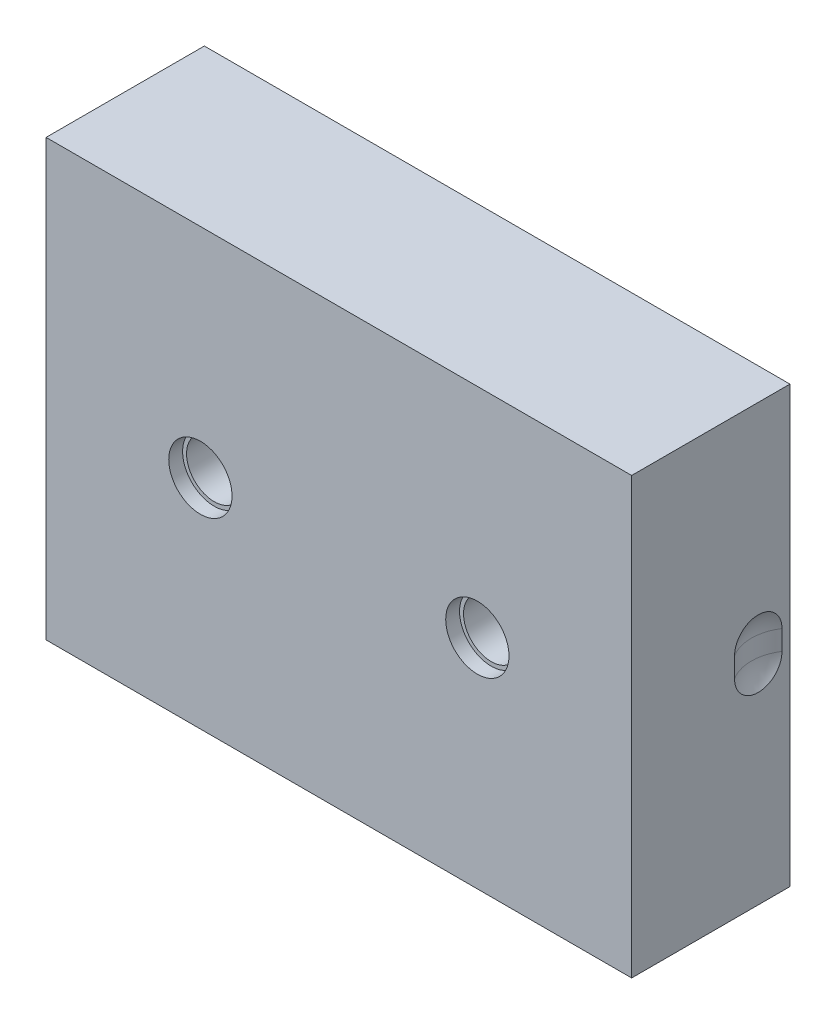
ISO-10303-21;
HEADER;
FILE_DESCRIPTION(('STEP AP214'),'2;1');
FILE_NAME('part.step','',(''),(''),'','','');
FILE_SCHEMA(('AUTOMOTIVE_DESIGN { 1 0 10303 214 1 1 1 1 }'));
ENDSEC;
DATA;
#1=APPLICATION_CONTEXT('core data for automotive mechanical design processes');
#2=APPLICATION_PROTOCOL_DEFINITION('international standard','automotive_design',2000,#1);
#3=PRODUCT_CONTEXT('',#1,'mechanical');
#4=PRODUCT('Part','Part','',(#3));
#5=PRODUCT_RELATED_PRODUCT_CATEGORY('part','',(#4));
#6=PRODUCT_DEFINITION_FORMATION('','',#4);
#7=PRODUCT_DEFINITION_CONTEXT('part definition',#1,'design');
#8=PRODUCT_DEFINITION('design','',#6,#7);
#9=PRODUCT_DEFINITION_SHAPE('','',#8);
#10=(LENGTH_UNIT() NAMED_UNIT(*) SI_UNIT(.MILLI.,.METRE.));
#11=(NAMED_UNIT(*) PLANE_ANGLE_UNIT() SI_UNIT($,.RADIAN.));
#12=(NAMED_UNIT(*) SI_UNIT($,.STERADIAN.) SOLID_ANGLE_UNIT());
#13=UNCERTAINTY_MEASURE_WITH_UNIT(LENGTH_MEASURE(1.E-05),#10,'distance_accuracy_value','');
#14=(GEOMETRIC_REPRESENTATION_CONTEXT(3) GLOBAL_UNCERTAINTY_ASSIGNED_CONTEXT((#13)) GLOBAL_UNIT_ASSIGNED_CONTEXT((#10,
#11,#12)) REPRESENTATION_CONTEXT('',''));
#15=CARTESIAN_POINT('',(0.,0.,0.));
#16=DIRECTION('',(0.,0.,1.));
#17=DIRECTION('',(1.,0.,0.));
#18=AXIS2_PLACEMENT_3D('',#15,#16,#17);
#19=CARTESIAN_POINT('',(13.9999999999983,193.,8.0000000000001));
#20=DIRECTION('',(0.,0.,-1.));
#21=DIRECTION('',(-1.,0.,0.));
#22=AXIS2_PLACEMENT_3D('',#19,#20,#21);
#23=PLANE('',#22);
#24=CARTESIAN_POINT('',(13.9999999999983,193.,8.0000000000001));
#25=DIRECTION('',(0.,0.,1.));
#26=DIRECTION('',(1.,0.,0.));
#27=AXIS2_PLACEMENT_3D('',#24,#25,#26);
#28=CIRCLE('',#27,7.);
#29=CARTESIAN_POINT('',(20.9999999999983,193.,8.0000000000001));
#30=VERTEX_POINT('',#29);
#31=EDGE_CURVE('E324',#30,#30,#28,.T.);
#32=ORIENTED_EDGE('',*,*,#31,.T.);
#33=EDGE_LOOP('',(#32));
#34=FACE_BOUND('',#33,.T.);
#35=CARTESIAN_POINT('',(13.9999999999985,193.,8.0000000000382));
#36=DIRECTION('',(0.,0.,1.));
#37=DIRECTION('',(1.,0.,0.));
#38=AXIS2_PLACEMENT_3D('',#35,#36,#37);
#39=CIRCLE('',#38,5.00000000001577);
#40=CARTESIAN_POINT('',(19.0000000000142,193.,8.0000000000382));
#41=VERTEX_POINT('',#40);
#42=EDGE_CURVE('E326',#41,#41,#39,.F.);
#43=ORIENTED_EDGE('',*,*,#42,.T.);
#44=EDGE_LOOP('',(#43));
#45=FACE_BOUND('',#44,.T.);
#46=ADVANCED_FACE('F14',(#34,#45),#23,.F.);
#47=CARTESIAN_POINT('',(83.9999999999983,193.,8.));
#48=DIRECTION('',(0.,0.,-1.));
#49=DIRECTION('',(-1.,0.,0.));
#50=AXIS2_PLACEMENT_3D('',#47,#48,#49);
#51=PLANE('',#50);
#52=CARTESIAN_POINT('',(83.9999999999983,193.,8.));
#53=DIRECTION('',(0.,0.,1.));
#54=DIRECTION('',(1.,0.,0.));
#55=AXIS2_PLACEMENT_3D('',#52,#53,#54);
#56=CIRCLE('',#55,7.);
#57=CARTESIAN_POINT('',(90.9999999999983,193.,8.));
#58=VERTEX_POINT('',#57);
#59=EDGE_CURVE('E320',#58,#58,#56,.T.);
#60=ORIENTED_EDGE('',*,*,#59,.T.);
#61=EDGE_LOOP('',(#60));
#62=FACE_BOUND('',#61,.T.);
#63=CARTESIAN_POINT('',(83.9999999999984,193.,8.0000000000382));
#64=DIRECTION('',(0.,0.,1.));
#65=DIRECTION('',(1.,0.,0.));
#66=AXIS2_PLACEMENT_3D('',#63,#64,#65);
#67=CIRCLE('',#66,5.00000000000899);
#68=CARTESIAN_POINT('',(89.0000000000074,193.,8.0000000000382));
#69=VERTEX_POINT('',#68);
#70=EDGE_CURVE('E18',#69,#69,#67,.F.);
#71=ORIENTED_EDGE('',*,*,#70,.T.);
#72=EDGE_LOOP('',(#71));
#73=FACE_BOUND('',#72,.T.);
#74=ADVANCED_FACE('F333',(#62,#73),#51,.F.);
#75=CARTESIAN_POINT('',(83.9999999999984,193.,7.99999999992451));
#76=DIRECTION('',(0.,0.,1.));
#77=DIRECTION('',(1.,0.,0.));
#78=AXIS2_PLACEMENT_3D('',#75,#76,#77);
#79=CONICAL_SURFACE('',#78,4.99999999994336,0.523598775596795);
#80=ORIENTED_EDGE('',*,*,#70,.F.);
#81=EDGE_LOOP('',(#80));
#82=FACE_BOUND('',#81,.T.);
#83=CARTESIAN_POINT('',(83.999999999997,193.,6.61435935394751));
#84=DIRECTION('',(6.07971206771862E-13,-4.81229605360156E-13,-1.));
#85=DIRECTION('',(-1.,0.,-6.07971206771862E-13));
#86=AXIS2_PLACEMENT_3D('',#83,#84,#85);
#87=CIRCLE('',#86,4.2);
#88=CARTESIAN_POINT('',(79.799999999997,193.,6.61435935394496));
#89=VERTEX_POINT('',#88);
#90=EDGE_CURVE('E323',#89,#89,#87,.T.);
#91=ORIENTED_EDGE('',*,*,#90,.T.);
#92=EDGE_LOOP('',(#91));
#93=FACE_BOUND('',#92,.T.);
#94=ADVANCED_FACE('F335',(#82,#93),#79,.F.);
#95=CARTESIAN_POINT('',(13.9999999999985,193.,7.99999999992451));
#96=DIRECTION('',(0.,0.,1.));
#97=DIRECTION('',(1.,0.,0.));
#98=AXIS2_PLACEMENT_3D('',#95,#96,#97);
#99=CONICAL_SURFACE('',#98,4.99999999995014,0.523598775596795);
#100=CARTESIAN_POINT('',(13.999999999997,193.,6.61435935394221));
#101=DIRECTION('',(6.56531207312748E-13,-5.27037872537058E-13,-1.));
#102=DIRECTION('',(-1.,0.,-6.56531207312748E-13));
#103=AXIS2_PLACEMENT_3D('',#100,#101,#102);
#104=CIRCLE('',#103,4.2);
#105=CARTESIAN_POINT('',(9.79999999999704,193.,6.61435935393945));
#106=VERTEX_POINT('',#105);
#107=EDGE_CURVE('E319',#106,#106,#104,.T.);
#108=ORIENTED_EDGE('',*,*,#107,.T.);
#109=EDGE_LOOP('',(#108));
#110=FACE_BOUND('',#109,.T.);
#111=ORIENTED_EDGE('',*,*,#42,.F.);
#112=EDGE_LOOP('',(#111));
#113=FACE_BOUND('',#112,.T.);
#114=ADVANCED_FACE('F338',(#110,#113),#99,.F.);
#115=CARTESIAN_POINT('',(13.9999999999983,193.,24.));
#116=DIRECTION('',(0.,0.,1.));
#117=DIRECTION('',(1.,0.,0.));
#118=AXIS2_PLACEMENT_3D('',#115,#116,#117);
#119=CYLINDRICAL_SURFACE('',#118,7.);
#120=ORIENTED_EDGE('',*,*,#31,.F.);
#121=EDGE_LOOP('',(#120));
#122=FACE_BOUND('',#121,.T.);
#123=CARTESIAN_POINT('',(13.9999999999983,193.,36.5));
#124=DIRECTION('',(0.,0.,1.));
#125=DIRECTION('',(1.,0.,0.));
#126=AXIS2_PLACEMENT_3D('',#123,#124,#125);
#127=CIRCLE('',#126,7.);
#128=CARTESIAN_POINT('',(20.9999999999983,193.,36.5));
#129=VERTEX_POINT('',#128);
#130=EDGE_CURVE('E316',#129,#129,#127,.T.);
#131=ORIENTED_EDGE('',*,*,#130,.T.);
#132=EDGE_LOOP('',(#131));
#133=FACE_BOUND('',#132,.T.);
#134=ADVANCED_FACE('F943',(#122,#133),#119,.F.);
#135=CARTESIAN_POINT('',(83.9999999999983,193.,24.));
#136=DIRECTION('',(0.,0.,1.));
#137=DIRECTION('',(1.,0.,0.));
#138=AXIS2_PLACEMENT_3D('',#135,#136,#137);
#139=CYLINDRICAL_SURFACE('',#138,7.);
#140=ORIENTED_EDGE('',*,*,#59,.F.);
#141=EDGE_LOOP('',(#140));
#142=FACE_BOUND('',#141,.T.);
#143=CARTESIAN_POINT('',(83.9999999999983,193.,36.5));
#144=DIRECTION('',(0.,0.,1.));
#145=DIRECTION('',(1.,0.,0.));
#146=AXIS2_PLACEMENT_3D('',#143,#144,#145);
#147=CIRCLE('',#146,7.);
#148=CARTESIAN_POINT('',(90.9999999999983,193.,36.5));
#149=VERTEX_POINT('',#148);
#150=EDGE_CURVE('E313',#149,#149,#147,.T.);
#151=ORIENTED_EDGE('',*,*,#150,.T.);
#152=EDGE_LOOP('',(#151));
#153=FACE_BOUND('',#152,.T.);
#154=ADVANCED_FACE('F935',(#142,#153),#139,.F.);
#155=CARTESIAN_POINT('',(83.999999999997,193.,6.61435935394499));
#156=DIRECTION('',(6.07971206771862E-13,-4.81229605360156E-13,-1.));
#157=DIRECTION('',(-1.,0.,-6.07971206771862E-13));
#158=AXIS2_PLACEMENT_3D('',#155,#156,#157);
#159=CYLINDRICAL_SURFACE('',#158,4.2);
#160=ORIENTED_EDGE('',*,*,#90,.F.);
#161=EDGE_LOOP('',(#160));
#162=FACE_BOUND('',#161,.T.);
#163=CARTESIAN_POINT('',(84.0000000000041,192.999999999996,-5.00000000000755));
#164=DIRECTION('',(6.07971206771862E-13,-4.81229605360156E-13,-1.));
#165=DIRECTION('',(-1.,0.,-6.07971206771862E-13));
#166=AXIS2_PLACEMENT_3D('',#163,#164,#165);
#167=CIRCLE('',#166,4.2);
#168=CARTESIAN_POINT('',(79.8000000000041,192.999999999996,-5.0000000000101));
#169=VERTEX_POINT('',#168);
#170=EDGE_CURVE('E310',#169,#169,#167,.F.);
#171=ORIENTED_EDGE('',*,*,#170,.F.);
#172=EDGE_LOOP('',(#171));
#173=FACE_BOUND('',#172,.T.);
#174=ADVANCED_FACE('F926',(#162,#173),#159,.F.);
#175=CARTESIAN_POINT('',(13.999999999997,193.,6.61435935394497));
#176=DIRECTION('',(6.56531207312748E-13,-5.27037872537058E-13,-1.));
#177=DIRECTION('',(-1.,0.,-6.56531207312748E-13));
#178=AXIS2_PLACEMENT_3D('',#175,#176,#177);
#179=CYLINDRICAL_SURFACE('',#178,4.2);
#180=CARTESIAN_POINT('',(14.0000000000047,192.999999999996,-4.99999999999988));
#181=DIRECTION('',(6.56531207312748E-13,-5.27037872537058E-13,-1.));
#182=DIRECTION('',(-1.,0.,-6.56531207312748E-13));
#183=AXIS2_PLACEMENT_3D('',#180,#181,#182);
#184=CIRCLE('',#183,4.2);
#185=CARTESIAN_POINT('',(9.80000000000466,192.999999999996,-5.00000000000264));
#186=VERTEX_POINT('',#185);
#187=EDGE_CURVE('E307',#186,#186,#184,.T.);
#188=ORIENTED_EDGE('',*,*,#187,.T.);
#189=EDGE_LOOP('',(#188));
#190=FACE_BOUND('',#189,.T.);
#191=ORIENTED_EDGE('',*,*,#107,.F.);
#192=EDGE_LOOP('',(#191));
#193=FACE_BOUND('',#192,.T.);
#194=ADVANCED_FACE('F917',(#190,#193),#179,.F.);
#195=CARTESIAN_POINT('',(13.9999999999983,193.,36.5));
#196=DIRECTION('',(0.,0.,-1.));
#197=DIRECTION('',(-1.,0.,0.));
#198=AXIS2_PLACEMENT_3D('',#195,#196,#197);
#199=PLANE('',#198);
#200=CARTESIAN_POINT('',(13.9999999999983,193.,36.5));
#201=DIRECTION('',(0.,0.,-1.));
#202=DIRECTION('',(-1.,0.,0.));
#203=AXIS2_PLACEMENT_3D('',#200,#201,#202);
#204=CIRCLE('',#203,8.);
#205=CARTESIAN_POINT('',(5.99999999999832,193.,36.5));
#206=VERTEX_POINT('',#205);
#207=EDGE_CURVE('E304',#206,#206,#204,.F.);
#208=ORIENTED_EDGE('',*,*,#207,.T.);
#209=EDGE_LOOP('',(#208));
#210=FACE_BOUND('',#209,.T.);
#211=ORIENTED_EDGE('',*,*,#130,.F.);
#212=EDGE_LOOP('',(#211));
#213=FACE_BOUND('',#212,.T.);
#214=ADVANCED_FACE('F908',(#210,#213),#199,.F.);
#215=CARTESIAN_POINT('',(83.9999999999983,193.,36.5));
#216=DIRECTION('',(0.,0.,-1.));
#217=DIRECTION('',(-1.,0.,0.));
#218=AXIS2_PLACEMENT_3D('',#215,#216,#217);
#219=PLANE('',#218);
#220=CARTESIAN_POINT('',(83.9999999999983,193.,36.5));
#221=DIRECTION('',(0.,0.,-1.));
#222=DIRECTION('',(-1.,0.,0.));
#223=AXIS2_PLACEMENT_3D('',#220,#221,#222);
#224=CIRCLE('',#223,8.);
#225=CARTESIAN_POINT('',(75.9999999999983,193.,36.5));
#226=VERTEX_POINT('',#225);
#227=EDGE_CURVE('E217',#226,#226,#224,.F.);
#228=ORIENTED_EDGE('',*,*,#227,.T.);
#229=EDGE_LOOP('',(#228));
#230=FACE_BOUND('',#229,.T.);
#231=ORIENTED_EDGE('',*,*,#150,.F.);
#232=EDGE_LOOP('',(#231));
#233=FACE_BOUND('',#232,.T.);
#234=ADVANCED_FACE('F900',(#230,#233),#219,.F.);
#235=CARTESIAN_POINT('',(90.1000000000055,190.119743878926,-4.99999999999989));
#236=DIRECTION('',(0.,0.,-1.));
#237=DIRECTION('',(-1.,0.,0.));
#238=AXIS2_PLACEMENT_3D('',#235,#236,#237);
#239=PLANE('',#238);
#240=DIRECTION('',(0.,1.,0.));
#241=VECTOR('',#240,1.);
#242=CARTESIAN_POINT('',(78.9000000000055,192.999999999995,-4.99999999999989));
#243=LINE('',#242,#241);
#244=CARTESIAN_POINT('',(78.9000000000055,195.466042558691,-4.99999999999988));
#245=VERTEX_POINT('',#244);
#246=CARTESIAN_POINT('',(78.9000000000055,190.533957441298,-4.99999999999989));
#247=VERTEX_POINT('',#246);
#248=EDGE_CURVE('E224',#245,#247,#243,.F.);
#249=ORIENTED_EDGE('',*,*,#248,.F.);
#250=DIRECTION('',(-0.707106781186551,-0.707106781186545,0.));
#251=VECTOR('',#250,1.);
#252=CARTESIAN_POINT('',(82.1375906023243,198.703633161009,-4.99999999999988));
#253=LINE('',#252,#251);
#254=CARTESIAN_POINT('',(82.1375906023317,198.70363316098,-5.00000000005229));
#255=VERTEX_POINT('',#254);
#256=EDGE_CURVE('E211',#255,#245,#253,.T.);
#257=ORIENTED_EDGE('',*,*,#256,.F.);
#258=CARTESIAN_POINT('',(84.0000000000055,192.999999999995,-5.00000000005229));
#259=DIRECTION('',(0.,0.,1.));
#260=DIRECTION('',(1.,0.,0.));
#261=AXIS2_PLACEMENT_3D('',#258,#259,#260);
#262=CIRCLE('',#261,5.99999999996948);
#263=CARTESIAN_POINT('',(82.1375906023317,187.296366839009,-5.0000000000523));
#264=VERTEX_POINT('',#263);
#265=EDGE_CURVE('E204',#264,#255,#262,.T.);
#266=ORIENTED_EDGE('',*,*,#265,.F.);
#267=DIRECTION('',(0.707106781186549,-0.707106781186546,0.));
#268=VECTOR('',#267,1.);
#269=CARTESIAN_POINT('',(78.9000000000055,190.533957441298,-4.99999999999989));
#270=LINE('',#269,#268);
#271=EDGE_CURVE('E209',#247,#264,#270,.T.);
#272=ORIENTED_EDGE('',*,*,#271,.F.);
#273=EDGE_LOOP('',(#249,#257,#266,#272));
#274=FACE_BOUND('',#273,.T.);
#275=ORIENTED_EDGE('',*,*,#170,.T.);
#276=EDGE_LOOP('',(#275));
#277=FACE_BOUND('',#276,.T.);
#278=ADVANCED_FACE('F207',(#274,#277),#239,.T.);
#279=CARTESIAN_POINT('',(14.0000000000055,192.999999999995,-4.99999999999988));
#280=DIRECTION('',(0.,0.,1.));
#281=DIRECTION('',(0.,-1.,0.));
#282=AXIS2_PLACEMENT_3D('',#279,#280,#281);
#283=PLANE('',#282);
#284=DIRECTION('',(0.707106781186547,0.707106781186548,0.));
#285=VECTOR('',#284,1.);
#286=CARTESIAN_POINT('',(15.8624093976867,187.29636683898,-4.99999999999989));
#287=LINE('',#286,#285);
#288=CARTESIAN_POINT('',(15.8624093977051,187.296366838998,-5.00000000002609));
#289=VERTEX_POINT('',#288);
#290=CARTESIAN_POINT('',(19.7036331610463,191.137590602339,-4.99999999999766));
#291=VERTEX_POINT('',#290);
#292=EDGE_CURVE('E719',#289,#291,#287,.T.);
#293=ORIENTED_EDGE('',*,*,#292,.F.);
#294=CARTESIAN_POINT('',(14.0000000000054,192.999999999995,-5.00000000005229));
#295=DIRECTION('',(0.,0.,1.));
#296=DIRECTION('',(1.,0.,0.));
#297=AXIS2_PLACEMENT_3D('',#294,#295,#296);
#298=CIRCLE('',#297,5.99999999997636);
#299=CARTESIAN_POINT('',(12.1375906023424,187.296366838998,-5.00000000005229));
#300=VERTEX_POINT('',#299);
#301=EDGE_CURVE('E708',#300,#289,#298,.T.);
#302=ORIENTED_EDGE('',*,*,#301,.F.);
#303=DIRECTION('',(0.707106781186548,-0.707106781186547,0.));
#304=VECTOR('',#303,1.);
#305=CARTESIAN_POINT('',(8.29636683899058,191.137590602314,-4.99999999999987));
#306=LINE('',#305,#304);
#307=CARTESIAN_POINT('',(8.29636683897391,191.137590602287,-4.99999999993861));
#308=VERTEX_POINT('',#307);
#309=EDGE_CURVE('E669',#308,#300,#306,.T.);
#310=ORIENTED_EDGE('',*,*,#309,.F.);
#311=CARTESIAN_POINT('',(14.0000000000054,192.999999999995,-4.99999999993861));
#312=DIRECTION('',(0.,0.,1.));
#313=DIRECTION('',(1.,0.,0.));
#314=AXIS2_PLACEMENT_3D('',#311,#312,#313);
#315=CIRCLE('',#314,6.0000000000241);
#316=CARTESIAN_POINT('',(8.29636683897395,194.862409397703,-4.99999999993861));
#317=VERTEX_POINT('',#316);
#318=EDGE_CURVE('E300',#317,#308,#315,.T.);
#319=ORIENTED_EDGE('',*,*,#318,.F.);
#320=DIRECTION('',(-0.707106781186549,-0.707106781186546,0.));
#321=VECTOR('',#320,1.);
#322=CARTESIAN_POINT('',(12.1375906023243,198.703633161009,-4.99999999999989));
#323=LINE('',#322,#321);
#324=CARTESIAN_POINT('',(12.1375906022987,198.703633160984,-4.99999999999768));
#325=VERTEX_POINT('',#324);
#326=EDGE_CURVE('E275',#325,#317,#323,.T.);
#327=ORIENTED_EDGE('',*,*,#326,.F.);
#328=CARTESIAN_POINT('',(14.0000000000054,192.999999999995,-4.99999999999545));
#329=DIRECTION('',(0.,0.,1.));
#330=DIRECTION('',(1.,0.,0.));
#331=AXIS2_PLACEMENT_3D('',#328,#329,#330);
#332=CIRCLE('',#331,5.99999999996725);
#333=CARTESIAN_POINT('',(15.8624093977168,198.703633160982,-4.99999999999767));
#334=VERTEX_POINT('',#333);
#335=EDGE_CURVE('E298',#334,#325,#332,.T.);
#336=ORIENTED_EDGE('',*,*,#335,.F.);
#337=DIRECTION('',(-0.707106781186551,0.707106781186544,0.));
#338=VECTOR('',#337,1.);
#339=CARTESIAN_POINT('',(19.7036331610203,194.862409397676,-4.99999999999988));
#340=LINE('',#339,#338);
#341=CARTESIAN_POINT('',(19.7036331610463,194.86240939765,-4.99999999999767));
#342=VERTEX_POINT('',#341);
#343=EDGE_CURVE('E736',#342,#334,#340,.T.);
#344=ORIENTED_EDGE('',*,*,#343,.F.);
#345=CARTESIAN_POINT('',(14.0000000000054,192.999999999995,-4.99999999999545));
#346=DIRECTION('',(0.,0.,1.));
#347=DIRECTION('',(1.,0.,0.));
#348=AXIS2_PLACEMENT_3D('',#345,#346,#347);
#349=CIRCLE('',#348,6.0000000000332);
#350=EDGE_CURVE('E720',#291,#342,#349,.T.);
#351=ORIENTED_EDGE('',*,*,#350,.F.);
#352=EDGE_LOOP('',(#293,#302,#310,#319,#327,#336,#344,#351));
#353=FACE_BOUND('',#352,.T.);
#354=ORIENTED_EDGE('',*,*,#187,.F.);
#355=EDGE_LOOP('',(#354));
#356=FACE_BOUND('',#355,.T.);
#357=ADVANCED_FACE('F765',(#353,#356),#283,.F.);
#358=CARTESIAN_POINT('',(13.9999999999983,193.,23.25));
#359=DIRECTION('',(0.,0.,-1.));
#360=DIRECTION('',(-1.,0.,0.));
#361=AXIS2_PLACEMENT_3D('',#358,#359,#360);
#362=CYLINDRICAL_SURFACE('',#361,8.);
#363=ORIENTED_EDGE('',*,*,#207,.F.);
#364=EDGE_LOOP('',(#363));
#365=FACE_BOUND('',#364,.T.);
#366=CARTESIAN_POINT('',(13.9999999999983,193.,40.));
#367=DIRECTION('',(0.,0.,-1.));
#368=DIRECTION('',(-1.,0.,0.));
#369=AXIS2_PLACEMENT_3D('',#366,#367,#368);
#370=CIRCLE('',#369,8.);
#371=CARTESIAN_POINT('',(5.99999999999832,193.,40.));
#372=VERTEX_POINT('',#371);
#373=EDGE_CURVE('E699',#372,#372,#370,.F.);
#374=ORIENTED_EDGE('',*,*,#373,.T.);
#375=EDGE_LOOP('',(#374));
#376=FACE_BOUND('',#375,.T.);
#377=ADVANCED_FACE('F877',(#365,#376),#362,.F.);
#378=CARTESIAN_POINT('',(83.9999999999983,193.,23.25));
#379=DIRECTION('',(0.,0.,-1.));
#380=DIRECTION('',(-1.,0.,0.));
#381=AXIS2_PLACEMENT_3D('',#378,#379,#380);
#382=CYLINDRICAL_SURFACE('',#381,8.);
#383=ORIENTED_EDGE('',*,*,#227,.F.);
#384=EDGE_LOOP('',(#383));
#385=FACE_BOUND('',#384,.T.);
#386=CARTESIAN_POINT('',(83.9999999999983,193.,40.));
#387=DIRECTION('',(0.,0.,-1.));
#388=DIRECTION('',(-1.,0.,0.));
#389=AXIS2_PLACEMENT_3D('',#386,#387,#388);
#390=CIRCLE('',#389,8.);
#391=CARTESIAN_POINT('',(75.9999999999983,193.,40.));
#392=VERTEX_POINT('',#391);
#393=EDGE_CURVE('E530',#392,#392,#390,.F.);
#394=ORIENTED_EDGE('',*,*,#393,.T.);
#395=EDGE_LOOP('',(#394));
#396=FACE_BOUND('',#395,.T.);
#397=ADVANCED_FACE('F870',(#385,#396),#382,.F.);
#398=CARTESIAN_POINT('',(84.0000000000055,192.999999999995,-4.00000000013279));
#399=DIRECTION('',(0.,0.,1.));
#400=DIRECTION('',(1.,0.,0.));
#401=AXIS2_PLACEMENT_3D('',#398,#399,#400);
#402=CONICAL_SURFACE('',#401,6.99999999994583,0.785398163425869);
#403=CARTESIAN_POINT('',(82.1375906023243,187.29636683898,-4.9999999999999));
#404=CARTESIAN_POINT('',(81.8795414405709,186.875962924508,-4.52026122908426));
#405=CARTESIAN_POINT('',(81.5928385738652,186.426905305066,-3.99999999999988));
#406=B_SPLINE_CURVE_WITH_KNOTS('',2,(#403,#404,#405),.UNSPECIFIED.,.F.,.F.,(3,3),(0.,1.),.UNSPECIFIED.);
#407=CARTESIAN_POINT('',(81.5928385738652,186.426905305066,-3.99999999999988));
#408=VERTEX_POINT('',#407);
#409=EDGE_CURVE('E216',#264,#408,#406,.T.);
#410=ORIENTED_EDGE('',*,*,#409,.F.);
#411=ORIENTED_EDGE('',*,*,#265,.T.);
#412=CARTESIAN_POINT('',(81.5928385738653,199.573094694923,-3.99999999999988));
#413=CARTESIAN_POINT('',(81.8795414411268,199.12403707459,-4.52026123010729));
#414=CARTESIAN_POINT('',(82.1375906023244,198.703633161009,-4.99999999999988));
#415=B_SPLINE_CURVE_WITH_KNOTS('',2,(#412,#413,#414),.UNSPECIFIED.,.F.,.F.,(3,3),(0.,1.),.UNSPECIFIED.);
#416=CARTESIAN_POINT('',(81.5928385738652,199.573094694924,-3.99999999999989));
#417=VERTEX_POINT('',#416);
#418=EDGE_CURVE('E258',#417,#255,#415,.T.);
#419=ORIENTED_EDGE('',*,*,#418,.F.);
#420=CARTESIAN_POINT('',(84.0000000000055,192.999999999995,-3.99999999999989));
#421=DIRECTION('',(0.,0.,-1.));
#422=DIRECTION('',(-1.,0.,0.));
#423=AXIS2_PLACEMENT_3D('',#420,#421,#422);
#424=CIRCLE('',#423,7.);
#425=CARTESIAN_POINT('',(86.407161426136,199.573094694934,-4.00000000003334));
#426=VERTEX_POINT('',#425);
#427=EDGE_CURVE('E527',#426,#417,#424,.F.);
#428=ORIENTED_EDGE('',*,*,#427,.F.);
#429=CARTESIAN_POINT('',(90.1000000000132,195.880256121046,-4.25419572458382));
#430=CARTESIAN_POINT('',(90.0312214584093,195.949034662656,-4.28702262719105));
#431=CARTESIAN_POINT('',(89.9620458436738,196.018210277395,-4.31817573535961));
#432=CARTESIAN_POINT('',(89.8229066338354,196.157349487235,-4.37683860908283));
#433=CARTESIAN_POINT('',(89.752942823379,196.227313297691,-4.40434735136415));
#434=CARTESIAN_POINT('',(89.5417507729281,196.438505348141,-4.48100425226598));
#435=CARTESIAN_POINT('',(89.3994037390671,196.580852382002,-4.52419474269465));
#436=CARTESIAN_POINT('',(89.1139436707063,196.866312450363,-4.59206614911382));
#437=CARTESIAN_POINT('',(88.9708520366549,197.009404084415,-4.61692541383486));
#438=CARTESIAN_POINT('',(88.6837316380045,197.296524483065,-4.6473203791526));
#439=CARTESIAN_POINT('',(88.539703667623,197.440552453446,-4.65287074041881));
#440=CARTESIAN_POINT('',(88.2547501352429,197.725505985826,-4.64441183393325));
#441=CARTESIAN_POINT('',(88.1138187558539,197.866437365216,-4.63078119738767));
#442=CARTESIAN_POINT('',(87.8333825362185,198.146873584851,-4.58546330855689));
#443=CARTESIAN_POINT('',(87.6938782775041,198.286377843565,-4.55376897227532));
#444=CARTESIAN_POINT('',(87.4172088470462,198.563047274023,-4.47404595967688));
#445=CARTESIAN_POINT('',(87.2800445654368,198.700211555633,-4.42601120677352));
#446=CARTESIAN_POINT('',(87.0085912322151,198.971664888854,-4.31579736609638));
#447=CARTESIAN_POINT('',(86.8743026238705,199.105953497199,-4.25361611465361));
#448=CARTESIAN_POINT('',(86.6852200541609,199.295036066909,-4.15658213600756));
#449=CARTESIAN_POINT('',(86.6291479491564,199.351108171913,-4.12659310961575));
#450=CARTESIAN_POINT('',(86.5176825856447,199.462573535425,-4.06470299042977));
#451=CARTESIAN_POINT('',(86.4622880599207,199.517968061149,-4.03280646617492));
#452=CARTESIAN_POINT('',(86.4071614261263,199.573094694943,-4.00000000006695));
#453=B_SPLINE_CURVE_WITH_KNOTS('',3,(#429,#430,#431,#432,#433,#434,#435,#436,#437,#438,#439,
#440,#441,#442,#443,#444,#445,#446,#447,#448,#449,#450,#451,#452),.UNSPECIFIED.,.F.,.F.,(4,2,2,
2,2,2,2,2,2,2,2,4),(0.,0.307945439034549,0.615977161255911,1.23285410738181,1.84364713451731,
2.45397630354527,3.05242522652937,3.65110900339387,4.25001565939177,4.84901397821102,
5.10333181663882,5.35706321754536),.UNSPECIFIED.);
#454=CARTESIAN_POINT('',(90.1000000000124,195.880256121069,-4.25419572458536));
#455=VERTEX_POINT('',#454);
#456=EDGE_CURVE('E529',#455,#426,#453,.T.);
#457=ORIENTED_EDGE('',*,*,#456,.F.);
#458=CARTESIAN_POINT('',(90.0999999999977,190.119743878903,-4.25419572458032));
#459=CARTESIAN_POINT('',(90.1000000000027,190.329175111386,-4.34361886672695));
#460=CARTESIAN_POINT('',(90.1000000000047,190.541739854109,-4.42640658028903));
#461=CARTESIAN_POINT('',(90.1000000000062,190.973367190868,-4.5753525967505));
#462=CARTESIAN_POINT('',(90.1000000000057,191.192449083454,-4.64145454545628));
#463=CARTESIAN_POINT('',(90.1000000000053,191.633602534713,-4.75243814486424));
#464=CARTESIAN_POINT('',(90.1000000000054,191.855618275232,-4.79753603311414));
#465=CARTESIAN_POINT('',(90.1000000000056,192.302910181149,-4.86427053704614));
#466=CARTESIAN_POINT('',(90.1000000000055,192.528181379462,-4.88593971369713));
#467=CARTESIAN_POINT('',(90.1000000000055,192.966825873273,-4.90361996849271));
#468=CARTESIAN_POINT('',(90.1000000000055,193.180142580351,-4.90102795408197));
#469=CARTESIAN_POINT('',(90.1000000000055,193.605433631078,-4.87370599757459));
#470=CARTESIAN_POINT('',(90.1000000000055,193.817407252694,-4.84896502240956));
#471=CARTESIAN_POINT('',(90.1000000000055,194.237790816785,-4.77913782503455));
#472=CARTESIAN_POINT('',(90.1000000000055,194.446202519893,-4.7340619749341));
#473=CARTESIAN_POINT('',(90.1000000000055,194.858419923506,-4.62629683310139));
#474=CARTESIAN_POINT('',(90.1000000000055,195.062224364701,-4.56360278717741));
#475=CARTESIAN_POINT('',(90.1000000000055,195.367753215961,-4.4573188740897));
#476=CARTESIAN_POINT('',(90.1000000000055,195.471382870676,-4.41906363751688));
#477=CARTESIAN_POINT('',(90.1000000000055,195.676981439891,-4.33912172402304));
#478=CARTESIAN_POINT('',(90.1000000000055,195.778954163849,-4.29744486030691));
#479=CARTESIAN_POINT('',(90.1000000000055,195.880256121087,-4.25419572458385));
#480=B_SPLINE_CURVE_WITH_KNOTS('',3,(#458,#459,#460,#461,#462,#463,#464,#465,#466,#467,#468,
#469,#470,#471,#472,#473,#474,#475,#476,#477,#478,#479),.UNSPECIFIED.,.F.,.F.,(4,2,2,2,2,2,2,2,
2,2,4),(0.,0.683472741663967,1.36922384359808,2.04774993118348,2.72533179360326,3.3641512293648,
4.00328905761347,4.64210125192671,5.28108599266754,5.61242800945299,5.94285088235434),.UNSPECIFIED.);
#481=CARTESIAN_POINT('',(90.1000000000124,190.119743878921,-4.25419572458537));
#482=VERTEX_POINT('',#481);
#483=EDGE_CURVE('E567',#482,#455,#480,.T.);
#484=ORIENTED_EDGE('',*,*,#483,.F.);
#485=CARTESIAN_POINT('',(86.4071614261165,186.42690530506,-4.0000000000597));
#486=CARTESIAN_POINT('',(86.561950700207,186.581694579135,-4.09213337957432));
#487=CARTESIAN_POINT('',(86.7190759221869,186.738819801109,-4.17718875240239));
#488=CARTESIAN_POINT('',(87.038137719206,187.057881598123,-4.32962757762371));
#489=CARTESIAN_POINT('',(87.2000892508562,187.219833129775,-4.39694793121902));
#490=CARTESIAN_POINT('',(87.5215538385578,187.541297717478,-4.5075342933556));
#491=CARTESIAN_POINT('',(87.6809215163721,187.700665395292,-4.55162511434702));
#492=CARTESIAN_POINT('',(88.0017954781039,188.021539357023,-4.61649212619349));
#493=CARTESIAN_POINT('',(88.1632978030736,188.183041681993,-4.63730663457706));
#494=CARTESIAN_POINT('',(88.472855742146,188.492599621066,-4.65338879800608));
#495=CARTESIAN_POINT('',(88.6208580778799,188.6406019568,-4.65072257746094));
#496=CARTESIAN_POINT('',(88.9161160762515,188.935859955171,-4.6248965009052));
#497=CARTESIAN_POINT('',(89.0633706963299,189.083114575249,-4.60171330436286));
#498=CARTESIAN_POINT('',(89.360993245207,189.380737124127,-4.53512849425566));
#499=CARTESIAN_POINT('',(89.5112824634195,189.531026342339,-4.49102919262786));
#500=CARTESIAN_POINT('',(89.7341243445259,189.753868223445,-4.41158535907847));
#501=CARTESIAN_POINT('',(89.8079129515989,189.827656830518,-4.38291749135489));
#502=CARTESIAN_POINT('',(89.9546144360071,189.974358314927,-4.32151682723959));
#503=CARTESIAN_POINT('',(90.0275275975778,190.047271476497,-4.28878539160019));
#504=CARTESIAN_POINT('',(90.1000000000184,190.119743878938,-4.25419572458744));
#505=B_SPLINE_CURVE_WITH_KNOTS('',3,(#485,#486,#487,#488,#489,#490,#491,#492,#493,#494,#495,
#496,#497,#498,#499,#500,#501,#502,#503,#504),.UNSPECIFIED.,.F.,.F.,(4,2,2,2,2,2,2,2,2,4),(0.,
0.71284111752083,1.42818518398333,2.11604513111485,2.80277104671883,3.42971756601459,
4.05737823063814,4.7076302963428,5.03221923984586,5.35669978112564),.UNSPECIFIED.);
#506=CARTESIAN_POINT('',(86.4071614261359,186.426905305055,-4.00000000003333));
#507=VERTEX_POINT('',#506);
#508=EDGE_CURVE('E576',#507,#482,#505,.T.);
#509=ORIENTED_EDGE('',*,*,#508,.F.);
#510=CARTESIAN_POINT('',(84.0000000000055,192.999999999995,-3.99999999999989));
#511=DIRECTION('',(0.,0.,-1.));
#512=DIRECTION('',(-1.,0.,0.));
#513=AXIS2_PLACEMENT_3D('',#510,#511,#512);
#514=CIRCLE('',#513,7.);
#515=EDGE_CURVE('E229',#408,#507,#514,.F.);
#516=ORIENTED_EDGE('',*,*,#515,.F.);
#517=EDGE_LOOP('',(#410,#411,#419,#428,#457,#484,#509,#516));
#518=FACE_BOUND('',#517,.T.);
#519=ADVANCED_FACE('F227',(#518),#402,.T.);
#520=CARTESIAN_POINT('',(81.3035533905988,187.423297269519,-4.49999999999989));
#521=DIRECTION('',(-0.5,-0.5,-0.707106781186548));
#522=DIRECTION('',(-0.816496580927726,0.,0.577350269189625));
#523=AXIS2_PLACEMENT_3D('',#520,#521,#522);
#524=PLANE('',#523);
#525=DIRECTION('',(-0.678598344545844,-0.281084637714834,0.678598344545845));
#526=VECTOR('',#525,1.);
#527=CARTESIAN_POINT('',(78.9000000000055,190.533957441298,-4.99999999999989));
#528=LINE('',#527,#526);
#529=CARTESIAN_POINT('',(77.9000000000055,190.119743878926,-3.99999999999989));
#530=VERTEX_POINT('',#529);
#531=EDGE_CURVE('E223',#247,#530,#528,.T.);
#532=ORIENTED_EDGE('',*,*,#531,.F.);
#533=ORIENTED_EDGE('',*,*,#271,.T.);
#534=ORIENTED_EDGE('',*,*,#409,.T.);
#535=DIRECTION('',(0.707106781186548,-0.707106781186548,0.));
#536=VECTOR('',#535,1.);
#537=CARTESIAN_POINT('',(77.9000000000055,190.119743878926,-3.99999999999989));
#538=LINE('',#537,#536);
#539=EDGE_CURVE('E505',#530,#408,#538,.T.);
#540=ORIENTED_EDGE('',*,*,#539,.F.);
#541=EDGE_LOOP('',(#532,#533,#534,#540));
#542=FACE_BOUND('',#541,.T.);
#543=ADVANCED_FACE('F220',(#542),#524,.T.);
#544=CARTESIAN_POINT('',(78.4000000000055,192.999999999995,-4.49999999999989));
#545=DIRECTION('',(-0.707106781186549,0.,-0.707106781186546));
#546=DIRECTION('',(-0.707106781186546,0.,0.707106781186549));
#547=AXIS2_PLACEMENT_3D('',#544,#545,#546);
#548=PLANE('',#547);
#549=ORIENTED_EDGE('',*,*,#531,.T.);
#550=DIRECTION('',(0.,1.,0.));
#551=VECTOR('',#550,1.);
#552=CARTESIAN_POINT('',(77.9000000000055,195.880256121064,-3.99999999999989));
#553=LINE('',#552,#551);
#554=CARTESIAN_POINT('',(77.9000000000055,195.880256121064,-3.99999999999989));
#555=VERTEX_POINT('',#554);
#556=EDGE_CURVE('E500',#555,#530,#553,.F.);
#557=ORIENTED_EDGE('',*,*,#556,.F.);
#558=DIRECTION('',(-0.678598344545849,0.281084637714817,0.678598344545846));
#559=VECTOR('',#558,1.);
#560=CARTESIAN_POINT('',(78.9000000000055,195.466042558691,-4.99999999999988));
#561=LINE('',#560,#559);
#562=EDGE_CURVE('E268',#245,#555,#561,.T.);
#563=ORIENTED_EDGE('',*,*,#562,.F.);
#564=ORIENTED_EDGE('',*,*,#248,.T.);
#565=EDGE_LOOP('',(#549,#557,#563,#564));
#566=FACE_BOUND('',#565,.T.);
#567=ADVANCED_FACE('F244',(#566),#548,.T.);
#568=CARTESIAN_POINT('',(81.7098446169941,198.982993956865,-4.49999999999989));
#569=DIRECTION('',(-0.5,0.5,-0.707106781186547));
#570=DIRECTION('',(0.,0.816496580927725,0.577350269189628));
#571=AXIS2_PLACEMENT_3D('',#568,#569,#570);
#572=PLANE('',#571);
#573=ORIENTED_EDGE('',*,*,#562,.T.);
#574=DIRECTION('',(-0.70710678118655,-0.707106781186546,0.));
#575=VECTOR('',#574,1.);
#576=CARTESIAN_POINT('',(81.5928385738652,199.573094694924,-3.99999999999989));
#577=LINE('',#576,#575);
#578=EDGE_CURVE('E491',#417,#555,#577,.T.);
#579=ORIENTED_EDGE('',*,*,#578,.F.);
#580=ORIENTED_EDGE('',*,*,#418,.T.);
#581=ORIENTED_EDGE('',*,*,#256,.T.);
#582=EDGE_LOOP('',(#573,#579,#580,#581));
#583=FACE_BOUND('',#582,.T.);
#584=ADVANCED_FACE('F249',(#583),#572,.T.);
#585=CARTESIAN_POINT('',(14.0000000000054,192.999999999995,-4.00000000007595));
#586=DIRECTION('',(0.,0.,1.));
#587=DIRECTION('',(1.,0.,0.));
#588=AXIS2_PLACEMENT_3D('',#585,#586,#587);
#589=CONICAL_SURFACE('',#588,6.99999999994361,0.785398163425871);
#590=CARTESIAN_POINT('',(8.29636683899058,194.862409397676,-4.99999999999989));
#591=CARTESIAN_POINT('',(7.87596292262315,195.120458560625,-4.5202612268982));
#592=CARTESIAN_POINT('',(7.42690530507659,195.407161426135,-3.99999999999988));
#593=B_SPLINE_CURVE_WITH_KNOTS('',2,(#590,#591,#592),.UNSPECIFIED.,.F.,.F.,(3,3),(0.,1.),.UNSPECIFIED.);
#594=CARTESIAN_POINT('',(7.4269053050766,195.407161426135,-3.99999999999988));
#595=VERTEX_POINT('',#594);
#596=EDGE_CURVE('E271',#317,#595,#593,.T.);
#597=ORIENTED_EDGE('',*,*,#596,.F.);
#598=ORIENTED_EDGE('',*,*,#318,.T.);
#599=CARTESIAN_POINT('',(7.42690530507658,190.592838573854,-3.99999999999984));
#600=CARTESIAN_POINT('',(7.87596292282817,190.879541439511,-4.52026122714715));
#601=CARTESIAN_POINT('',(8.29636683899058,191.137590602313,-4.99999999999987));
#602=B_SPLINE_CURVE_WITH_KNOTS('',2,(#599,#600,#601),.UNSPECIFIED.,.F.,.F.,(3,3),(0.,1.),.UNSPECIFIED.);
#603=CARTESIAN_POINT('',(7.42690530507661,190.592838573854,-3.99999999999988));
#604=VERTEX_POINT('',#603);
#605=EDGE_CURVE('E711',#604,#308,#602,.T.);
#606=ORIENTED_EDGE('',*,*,#605,.F.);
#607=CARTESIAN_POINT('',(14.0000000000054,192.999999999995,-3.99999999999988));
#608=DIRECTION('',(0.,0.,1.));
#609=DIRECTION('',(1.,0.,0.));
#610=AXIS2_PLACEMENT_3D('',#607,#608,#609);
#611=CIRCLE('',#610,7.);
#612=EDGE_CURVE('E488',#595,#604,#611,.T.);
#613=ORIENTED_EDGE('',*,*,#612,.F.);
#614=EDGE_LOOP('',(#597,#598,#606,#613));
#615=FACE_BOUND('',#614,.T.);
#616=ADVANCED_FACE('F254',(#615),#589,.T.);
#617=CARTESIAN_POINT('',(8.82194201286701,196.095091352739,-4.49999999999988));
#618=DIRECTION('',(-0.5,0.5,-0.707106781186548));
#619=DIRECTION('',(-0.816496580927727,0.,0.577350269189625));
#620=AXIS2_PLACEMENT_3D('',#617,#618,#619);
#621=PLANE('',#620);
#622=ORIENTED_EDGE('',*,*,#596,.T.);
#623=DIRECTION('',(-0.707106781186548,-0.707106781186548,0.));
#624=VECTOR('',#623,1.);
#625=CARTESIAN_POINT('',(7.4269053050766,195.407161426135,-3.99999999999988));
#626=LINE('',#625,#624);
#627=CARTESIAN_POINT('',(11.5928385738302,199.573094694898,-3.99999999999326));
#628=VERTEX_POINT('',#627);
#629=EDGE_CURVE('E484',#628,#595,#626,.T.);
#630=ORIENTED_EDGE('',*,*,#629,.F.);
#631=CARTESIAN_POINT('',(12.1375906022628,198.703633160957,-4.99999999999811));
#632=CARTESIAN_POINT('',(12.0479899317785,198.849489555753,-4.83350671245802));
#633=CARTESIAN_POINT('',(11.9577935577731,198.994872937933,-4.66692666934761));
#634=CARTESIAN_POINT('',(11.7762095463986,199.284693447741,-4.33359333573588));
#635=CARTESIAN_POINT('',(11.6848219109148,199.429130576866,-4.16684004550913));
#636=CARTESIAN_POINT('',(11.5928385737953,199.573094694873,-3.99999999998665));
#637=B_SPLINE_CURVE_WITH_KNOTS('',3,(#631,#632,#633,#634,#635,#636),.UNSPECIFIED.,.F.,.F.,(4,2,
4),(0.,0.716369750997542,1.43273836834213),.UNSPECIFIED.);
#638=EDGE_CURVE('E274',#325,#628,#637,.T.);
#639=ORIENTED_EDGE('',*,*,#638,.F.);
#640=ORIENTED_EDGE('',*,*,#326,.T.);
#641=EDGE_LOOP('',(#622,#630,#639,#640));
#642=FACE_BOUND('',#641,.T.);
#643=ADVANCED_FACE('F277',(#642),#621,.T.);
#644=CARTESIAN_POINT('',(14.0000000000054,192.999999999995,-3.99999999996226));
#645=DIRECTION('',(0.,0.,1.));
#646=DIRECTION('',(1.,0.,0.));
#647=AXIS2_PLACEMENT_3D('',#644,#645,#646);
#648=CONICAL_SURFACE('',#647,7.00000000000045,0.785398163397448);
#649=CARTESIAN_POINT('',(15.8624093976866,198.703633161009,-4.99999999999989));
#650=CARTESIAN_POINT('',(16.1204585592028,199.124037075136,-4.52026122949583));
#651=CARTESIAN_POINT('',(16.4071614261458,199.573094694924,-3.99999999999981));
#652=B_SPLINE_CURVE_WITH_KNOTS('',2,(#649,#650,#651),.UNSPECIFIED.,.F.,.F.,(3,3),(0.,1.),.UNSPECIFIED.);
#653=CARTESIAN_POINT('',(16.4071614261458,199.573094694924,-3.99999999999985));
#654=VERTEX_POINT('',#653);
#655=EDGE_CURVE('E792',#334,#654,#652,.T.);
#656=ORIENTED_EDGE('',*,*,#655,.F.);
#657=ORIENTED_EDGE('',*,*,#335,.T.);
#658=ORIENTED_EDGE('',*,*,#638,.T.);
#659=CARTESIAN_POINT('',(14.0000000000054,192.999999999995,-3.99999999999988));
#660=DIRECTION('',(0.,0.,1.));
#661=DIRECTION('',(1.,0.,0.));
#662=AXIS2_PLACEMENT_3D('',#659,#660,#661);
#663=CIRCLE('',#662,7.);
#664=EDGE_CURVE('E481',#654,#628,#663,.T.);
#665=ORIENTED_EDGE('',*,*,#664,.F.);
#666=EDGE_LOOP('',(#656,#657,#658,#665));
#667=FACE_BOUND('',#666,.T.);
#668=ADVANCED_FACE('F286',(#667),#648,.T.);
#669=CARTESIAN_POINT('',(17.0950913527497,198.178057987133,-4.49999999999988));
#670=DIRECTION('',(0.5,0.5,-0.707106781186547));
#671=DIRECTION('',(0.,0.816496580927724,0.577350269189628));
#672=AXIS2_PLACEMENT_3D('',#669,#670,#671);
#673=PLANE('',#672);
#674=ORIENTED_EDGE('',*,*,#655,.T.);
#675=DIRECTION('',(-0.707106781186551,0.707106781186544,0.));
#676=VECTOR('',#675,1.);
#677=CARTESIAN_POINT('',(16.4071614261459,199.573094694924,-3.99999999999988));
#678=LINE('',#677,#676);
#679=CARTESIAN_POINT('',(20.5730946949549,195.407161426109,-4.00000000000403));
#680=VERTEX_POINT('',#679);
#681=EDGE_CURVE('E478',#680,#654,#678,.T.);
#682=ORIENTED_EDGE('',*,*,#681,.F.);
#683=CARTESIAN_POINT('',(19.7036331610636,194.86240939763,-4.99999999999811));
#684=CARTESIAN_POINT('',(19.8494895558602,194.952010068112,-4.833506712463));
#685=CARTESIAN_POINT('',(19.9948729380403,195.042206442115,-4.66692666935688));
#686=CARTESIAN_POINT('',(20.2846934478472,195.223790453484,-4.33359333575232));
#687=CARTESIAN_POINT('',(20.4291305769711,195.315178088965,-4.16684004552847));
#688=CARTESIAN_POINT('',(20.5730946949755,195.407161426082,-4.00000000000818));
#689=B_SPLINE_CURVE_WITH_KNOTS('',3,(#683,#684,#685,#686,#687,#688),.UNSPECIFIED.,.F.,.F.,(4,2,
4),(0.,0.71636975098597,1.43273836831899),.UNSPECIFIED.);
#690=EDGE_CURVE('E809',#342,#680,#689,.T.);
#691=ORIENTED_EDGE('',*,*,#690,.F.);
#692=ORIENTED_EDGE('',*,*,#343,.T.);
#693=EDGE_LOOP('',(#674,#682,#691,#692));
#694=FACE_BOUND('',#693,.T.);
#695=ADVANCED_FACE('F808',(#694),#673,.T.);
#696=CARTESIAN_POINT('',(14.0000000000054,192.999999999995,-4.0000000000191));
#697=DIRECTION('',(0.,0.,1.));
#698=DIRECTION('',(1.,0.,0.));
#699=AXIS2_PLACEMENT_3D('',#696,#697,#698);
#700=CONICAL_SURFACE('',#699,7.00000000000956,0.785398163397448);
#701=CARTESIAN_POINT('',(19.7036331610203,191.137590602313,-4.99999999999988));
#702=CARTESIAN_POINT('',(20.1240370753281,190.879541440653,-4.52026122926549));
#703=CARTESIAN_POINT('',(20.5730946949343,190.592838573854,-3.99999999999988));
#704=B_SPLINE_CURVE_WITH_KNOTS('',2,(#701,#702,#703),.UNSPECIFIED.,.F.,.F.,(3,3),(0.,1.),.UNSPECIFIED.);
#705=CARTESIAN_POINT('',(20.5730946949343,190.592838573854,-3.99999999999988));
#706=VERTEX_POINT('',#705);
#707=EDGE_CURVE('E732',#291,#706,#704,.T.);
#708=ORIENTED_EDGE('',*,*,#707,.F.);
#709=ORIENTED_EDGE('',*,*,#350,.T.);
#710=ORIENTED_EDGE('',*,*,#690,.T.);
#711=CARTESIAN_POINT('',(14.0000000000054,192.999999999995,-3.99999999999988));
#712=DIRECTION('',(0.,0.,1.));
#713=DIRECTION('',(1.,0.,0.));
#714=AXIS2_PLACEMENT_3D('',#711,#712,#713);
#715=CIRCLE('',#714,7.);
#716=EDGE_CURVE('E475',#706,#680,#715,.T.);
#717=ORIENTED_EDGE('',*,*,#716,.F.);
#718=EDGE_LOOP('',(#708,#709,#710,#717));
#719=FACE_BOUND('',#718,.T.);
#720=ADVANCED_FACE('F727',(#719),#700,.T.);
#721=CARTESIAN_POINT('',(19.1780579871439,189.904908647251,-4.49999999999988));
#722=DIRECTION('',(0.5,-0.5,-0.707106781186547));
#723=DIRECTION('',(-0.816496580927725,0.,-0.577350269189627));
#724=AXIS2_PLACEMENT_3D('',#721,#722,#723);
#725=PLANE('',#724);
#726=CARTESIAN_POINT('',(15.8624093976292,187.296366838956,-5.00000000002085));
#727=CARTESIAN_POINT('',(15.9520100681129,187.150510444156,-4.83350671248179));
#728=CARTESIAN_POINT('',(16.0422064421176,187.005127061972,-4.66692666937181));
#729=CARTESIAN_POINT('',(16.2237904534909,186.715306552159,-4.33359333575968));
#730=CARTESIAN_POINT('',(16.3151780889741,186.570869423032,-4.16684004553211));
#731=CARTESIAN_POINT('',(16.4071614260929,186.426905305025,-4.0000000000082));
#732=B_SPLINE_CURVE_WITH_KNOTS('',3,(#726,#727,#728,#729,#730,#731),.UNSPECIFIED.,.F.,.F.,(4,2,
4),(0.,0.716369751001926,1.43273836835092),.UNSPECIFIED.);
#733=CARTESIAN_POINT('',(16.4071614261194,186.426905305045,-4.00000000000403));
#734=VERTEX_POINT('',#733);
#735=EDGE_CURVE('E712',#289,#734,#732,.T.);
#736=ORIENTED_EDGE('',*,*,#735,.F.);
#737=ORIENTED_EDGE('',*,*,#292,.T.);
#738=ORIENTED_EDGE('',*,*,#707,.T.);
#739=DIRECTION('',(0.707106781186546,0.70710678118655,0.));
#740=VECTOR('',#739,1.);
#741=CARTESIAN_POINT('',(20.5730946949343,190.592838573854,-3.99999999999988));
#742=LINE('',#741,#740);
#743=EDGE_CURVE('E472',#734,#706,#742,.T.);
#744=ORIENTED_EDGE('',*,*,#743,.F.);
#745=EDGE_LOOP('',(#736,#737,#738,#744));
#746=FACE_BOUND('',#745,.T.);
#747=ADVANCED_FACE('F723',(#746),#725,.T.);
#748=CARTESIAN_POINT('',(14.0000000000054,192.999999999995,-4.00000000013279));
#749=DIRECTION('',(0.,0.,1.));
#750=DIRECTION('',(1.,0.,0.));
#751=AXIS2_PLACEMENT_3D('',#748,#749,#750);
#752=CONICAL_SURFACE('',#751,6.99999999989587,0.785398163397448);
#753=CARTESIAN_POINT('',(12.1375906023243,187.29636683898,-4.99999999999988));
#754=CARTESIAN_POINT('',(11.8795414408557,186.875962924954,-4.52026122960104));
#755=CARTESIAN_POINT('',(11.5928385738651,186.426905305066,-3.99999999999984));
#756=B_SPLINE_CURVE_WITH_KNOTS('',2,(#753,#754,#755),.UNSPECIFIED.,.F.,.F.,(3,3),(0.,1.),.UNSPECIFIED.);
#757=CARTESIAN_POINT('',(11.5928385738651,186.426905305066,-3.99999999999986));
#758=VERTEX_POINT('',#757);
#759=EDGE_CURVE('E707',#300,#758,#756,.T.);
#760=ORIENTED_EDGE('',*,*,#759,.F.);
#761=ORIENTED_EDGE('',*,*,#301,.T.);
#762=ORIENTED_EDGE('',*,*,#735,.T.);
#763=CARTESIAN_POINT('',(14.0000000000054,192.999999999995,-3.99999999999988));
#764=DIRECTION('',(0.,0.,1.));
#765=DIRECTION('',(1.,0.,0.));
#766=AXIS2_PLACEMENT_3D('',#763,#764,#765);
#767=CIRCLE('',#766,7.);
#768=EDGE_CURVE('E469',#758,#734,#767,.T.);
#769=ORIENTED_EDGE('',*,*,#768,.F.);
#770=EDGE_LOOP('',(#760,#761,#762,#769));
#771=FACE_BOUND('',#770,.T.);
#772=ADVANCED_FACE('F721',(#771),#752,.T.);
#773=CARTESIAN_POINT('',(10.9049086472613,187.821942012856,-4.49999999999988));
#774=DIRECTION('',(-0.5,-0.5,-0.707106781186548));
#775=DIRECTION('',(-0.816496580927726,0.,0.577350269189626));
#776=AXIS2_PLACEMENT_3D('',#773,#774,#775);
#777=PLANE('',#776);
#778=ORIENTED_EDGE('',*,*,#759,.T.);
#779=DIRECTION('',(0.707106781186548,-0.707106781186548,0.));
#780=VECTOR('',#779,1.);
#781=CARTESIAN_POINT('',(11.5928385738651,186.426905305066,-3.99999999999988));
#782=LINE('',#781,#780);
#783=EDGE_CURVE('E463',#604,#758,#782,.T.);
#784=ORIENTED_EDGE('',*,*,#783,.F.);
#785=ORIENTED_EDGE('',*,*,#605,.T.);
#786=ORIENTED_EDGE('',*,*,#309,.T.);
#787=EDGE_LOOP('',(#778,#784,#785,#786));
#788=FACE_BOUND('',#787,.T.);
#789=ADVANCED_FACE('F662',(#788),#777,.T.);
#790=CARTESIAN_POINT('',(-34.34,190.497866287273,8.));
#791=DIRECTION('',(0.257787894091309,0.964949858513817,0.0491647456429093));
#792=DIRECTION('',(-0.966113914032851,0.256745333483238,0.0265657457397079));
#793=AXIS2_PLACEMENT_3D('',#790,#791,#792);
#794=SPHERICAL_SURFACE('',#793,11.1);
#795=CARTESIAN_POINT('',(-34.34,190.497866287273,8.));
#796=DIRECTION('',(0.,-1.,0.));
#797=DIRECTION('',(0.,0.,-1.));
#798=AXIS2_PLACEMENT_3D('',#795,#796,#797);
#799=CIRCLE('',#798,11.1);
#800=CARTESIAN_POINT('',(-25.,190.497866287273,13.9978662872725));
#801=VERTEX_POINT('',#800);
#802=CARTESIAN_POINT('',(-25.,190.497866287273,2.00213371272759));
#803=VERTEX_POINT('',#802);
#804=EDGE_CURVE('E702',#801,#803,#799,.F.);
#805=ORIENTED_EDGE('',*,*,#804,.T.);
#806=CARTESIAN_POINT('',(-25.,190.497866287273,2.00213371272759));
#807=CARTESIAN_POINT('',(-25.,190.329174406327,2.00211557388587));
#808=CARTESIAN_POINT('',(-25.,190.16048513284,2.00924971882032));
#809=CARTESIAN_POINT('',(-25.,189.824313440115,2.0376915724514));
#810=CARTESIAN_POINT('',(-25.,189.656830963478,2.05899860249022));
#811=CARTESIAN_POINT('',(-25.,189.324375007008,2.11563533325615));
#812=CARTESIAN_POINT('',(-25.,189.159399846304,2.15095516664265));
#813=CARTESIAN_POINT('',(-25.,188.833011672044,2.23536054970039));
#814=CARTESIAN_POINT('',(-25.,188.671598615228,2.28444593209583));
#815=CARTESIAN_POINT('',(-25.,188.353433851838,2.39605139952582));
#816=CARTESIAN_POINT('',(-25.,188.196683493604,2.45857532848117));
#817=CARTESIAN_POINT('',(-25.,187.888949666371,2.59663030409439));
#818=CARTESIAN_POINT('',(-25.,187.737968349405,2.67216614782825));
#819=CARTESIAN_POINT('',(-25.,187.442991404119,2.83564546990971));
#820=CARTESIAN_POINT('',(-25.,187.298991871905,2.92358190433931));
#821=CARTESIAN_POINT('',(-25.,187.018858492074,3.11130448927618));
#822=CARTESIAN_POINT('',(-25.,186.882727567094,3.21109500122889));
#823=CARTESIAN_POINT('',(-25.,186.619402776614,3.42175358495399));
#824=CARTESIAN_POINT('',(-25.,186.492205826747,3.53261780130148));
#825=CARTESIAN_POINT('',(-25.,186.247555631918,3.76470784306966));
#826=CARTESIAN_POINT('',(-25.,186.130106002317,3.88593747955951));
#827=CARTESIAN_POINT('',(-25.,185.905862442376,4.13783366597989));
#828=CARTESIAN_POINT('',(-25.,185.799066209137,4.26849816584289));
#829=CARTESIAN_POINT('',(-25.,185.596822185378,4.53840849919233));
#830=CARTESIAN_POINT('',(-25.,185.501378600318,4.67765748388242));
#831=CARTESIAN_POINT('',(-25.,185.322601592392,4.96364347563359));
#832=CARTESIAN_POINT('',(-25.,185.239263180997,5.11037736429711));
#833=CARTESIAN_POINT('',(-25.,185.085213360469,5.41039872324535));
#834=CARTESIAN_POINT('',(-25.,185.014506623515,5.56368859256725));
#835=CARTESIAN_POINT('',(-25.,184.886288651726,5.87561339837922));
#836=CARTESIAN_POINT('',(-25.,184.828771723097,6.03424599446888));
#837=CARTESIAN_POINT('',(-25.,184.72728423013,6.35585112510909));
#838=CARTESIAN_POINT('',(-25.,184.683318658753,6.51882523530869));
#839=CARTESIAN_POINT('',(-25.,184.609287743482,6.84784269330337));
#840=CARTESIAN_POINT('',(-25.,184.579217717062,7.01388498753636));
#841=CARTESIAN_POINT('',(-25.,184.533161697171,7.34797042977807));
#842=CARTESIAN_POINT('',(-25.,184.517180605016,7.51601425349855));
#843=CARTESIAN_POINT('',(-25.,184.499435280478,7.85282542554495));
#844=CARTESIAN_POINT('',(-25.,184.497668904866,8.02159266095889));
#845=CARTESIAN_POINT('',(-25.,184.508359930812,8.35867600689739));
#846=CARTESIAN_POINT('',(-25.,184.520817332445,8.52699211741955));
#847=CARTESIAN_POINT('',(-25.,184.55987056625,8.8620040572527));
#848=CARTESIAN_POINT('',(-25.,184.586468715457,9.02869961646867));
#849=CARTESIAN_POINT('',(-25.,184.653604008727,9.35919935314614));
#850=CARTESIAN_POINT('',(-25.,184.694136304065,9.52300451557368));
#851=CARTESIAN_POINT('',(-25.,184.788870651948,9.84667630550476));
#852=CARTESIAN_POINT('',(-25.,184.84307754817,10.0065415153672));
#853=CARTESIAN_POINT('',(-25.,184.964746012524,10.3210781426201));
#854=CARTESIAN_POINT('',(-25.,185.032202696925,10.4757514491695));
#855=CARTESIAN_POINT('',(-25.,185.179933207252,10.7789267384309));
#856=CARTESIAN_POINT('',(-25.,185.260212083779,10.927426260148));
#857=CARTESIAN_POINT('',(-25.,185.432964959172,11.2170793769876));
#858=CARTESIAN_POINT('',(-25.,185.525434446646,11.3582356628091));
#859=CARTESIAN_POINT('',(-25.,185.721965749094,11.6323019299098));
#860=CARTESIAN_POINT('',(-25.,185.826031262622,11.7652092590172));
#861=CARTESIAN_POINT('',(-25.,186.044949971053,12.021735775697));
#862=CARTESIAN_POINT('',(-25.,186.159799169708,12.1453583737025));
#863=CARTESIAN_POINT('',(-25.,186.399529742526,12.3825190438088));
#864=CARTESIAN_POINT('',(-25.,186.524413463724,12.4960547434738));
#865=CARTESIAN_POINT('',(-25.,186.783253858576,12.7121618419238));
#866=CARTESIAN_POINT('',(-25.,186.917207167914,12.8147372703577));
#867=CARTESIAN_POINT('',(-25.,187.19337123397,13.0083097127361));
#868=CARTESIAN_POINT('',(-25.,187.335587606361,13.0992987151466));
#869=CARTESIAN_POINT('',(-25.,187.62712835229,13.2689369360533));
#870=CARTESIAN_POINT('',(-25.,187.776450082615,13.3475906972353));
#871=CARTESIAN_POINT('',(-25.,188.081338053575,13.4921107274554));
#872=CARTESIAN_POINT('',(-25.,188.236910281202,13.55796436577));
#873=CARTESIAN_POINT('',(-25.,188.552995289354,13.6762965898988));
#874=CARTESIAN_POINT('',(-25.,188.713506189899,13.728780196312));
#875=CARTESIAN_POINT('',(-25.,189.038197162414,13.8199805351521));
#876=CARTESIAN_POINT('',(-25.,189.202372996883,13.8587123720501));
#877=CARTESIAN_POINT('',(-25.,189.533337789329,13.9222002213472));
#878=CARTESIAN_POINT('',(-25.,189.700125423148,13.9469630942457));
#879=CARTESIAN_POINT('',(-25.,189.972374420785,13.9757308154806));
#880=CARTESIAN_POINT('',(-25.,190.077399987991,13.9840369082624));
#881=CARTESIAN_POINT('',(-25.,190.287568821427,13.9951006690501));
#882=CARTESIAN_POINT('',(-25.,190.392711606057,13.9978674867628));
#883=CARTESIAN_POINT('',(-25.,190.497866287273,13.9978662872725));
#884=B_SPLINE_CURVE_WITH_KNOTS('',3,(#806,#807,#808,#809,#810,#811,#812,#813,#814,#815,#816,
#817,#818,#819,#820,#821,#822,#823,#824,#825,#826,#827,#828,#829,#830,#831,#832,#833,#834,#835,
#836,#837,#838,#839,#840,#841,#842,#843,#844,#845,#846,#847,#848,#849,#850,#851,#852,#853,#854,
#855,#856,#857,#858,#859,#860,#861,#862,#863,#864,#865,#866,#867,#868,#869,#870,#871,#872,#873,
#874,#875,#876,#877,#878,#879,#880,#881,#882,#883),.UNSPECIFIED.,.F.,.F.,(4,2,2,2,2,2,2,2,2,2,2,
2,2,2,2,2,2,2,2,2,2,2,2,2,2,2,2,2,2,2,2,2,2,2,2,2,2,2,4),(0.,0.505921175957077,1.01181812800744,
1.51735947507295,2.02289467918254,2.52857467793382,3.03444150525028,3.54002213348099,
4.04578935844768,4.55138110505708,5.05715954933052,5.56282842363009,6.06868403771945,
6.57433059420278,7.08016379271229,7.58577821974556,8.09157871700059,8.59720864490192,
9.10301440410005,9.60874389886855,10.1144733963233,10.620285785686,11.1259223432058,
11.6317382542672,12.1373680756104,12.6431975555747,13.1488403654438,13.6546449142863,
14.1602627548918,14.6659992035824,15.171549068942,15.677446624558,16.1831574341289,
16.6893647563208,17.1953817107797,17.7008411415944,18.2060521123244,18.5219783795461,
18.8373823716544),.UNSPECIFIED.);
#885=EDGE_CURVE('E591',#803,#801,#884,.T.);
#886=ORIENTED_EDGE('',*,*,#885,.T.);
#887=EDGE_LOOP('',(#805,#886));
#888=FACE_BOUND('',#887,.T.);
#889=ADVANCED_FACE('F655',(#888),#794,.F.);
#890=CARTESIAN_POINT('',(-34.34,252.118983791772,8.));
#891=DIRECTION('',(0.,-1.,0.));
#892=DIRECTION('',(0.,0.,-1.));
#893=AXIS2_PLACEMENT_3D('',#890,#891,#892);
#894=CYLINDRICAL_SURFACE('',#893,11.1);
#895=DIRECTION('',(0.,1.,0.));
#896=VECTOR('',#895,1.);
#897=CARTESIAN_POINT('',(-25.,193.,2.0021337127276));
#898=LINE('',#897,#896);
#899=CARTESIAN_POINT('',(-25.,195.502133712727,2.00213371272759));
#900=VERTEX_POINT('',#899);
#901=EDGE_CURVE('E592',#900,#803,#898,.F.);
#902=ORIENTED_EDGE('',*,*,#901,.T.);
#903=ORIENTED_EDGE('',*,*,#804,.F.);
#904=DIRECTION('',(0.,1.,0.));
#905=VECTOR('',#904,1.);
#906=CARTESIAN_POINT('',(-25.,193.,13.9978662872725));
#907=LINE('',#906,#905);
#908=CARTESIAN_POINT('',(-25.,195.502133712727,13.9978662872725));
#909=VERTEX_POINT('',#908);
#910=EDGE_CURVE('E587',#801,#909,#907,.T.);
#911=ORIENTED_EDGE('',*,*,#910,.T.);
#912=CARTESIAN_POINT('',(-34.34,195.502133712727,8.));
#913=DIRECTION('',(0.,-1.,0.));
#914=DIRECTION('',(0.,0.,-1.));
#915=AXIS2_PLACEMENT_3D('',#912,#913,#914);
#916=CIRCLE('',#915,11.1);
#917=EDGE_CURVE('E697',#909,#900,#916,.F.);
#918=ORIENTED_EDGE('',*,*,#917,.T.);
#919=EDGE_LOOP('',(#902,#903,#911,#918));
#920=FACE_BOUND('',#919,.T.);
#921=ADVANCED_FACE('F661',(#920),#894,.F.);
#922=CARTESIAN_POINT('',(-34.34,195.502133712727,8.));
#923=DIRECTION('',(0.257787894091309,0.964949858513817,0.0491647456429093));
#924=DIRECTION('',(-0.966113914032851,0.256745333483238,0.0265657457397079));
#925=AXIS2_PLACEMENT_3D('',#922,#923,#924);
#926=SPHERICAL_SURFACE('',#925,11.1);
#927=ORIENTED_EDGE('',*,*,#917,.F.);
#928=CARTESIAN_POINT('',(-25.,195.502133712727,13.9978662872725));
#929=CARTESIAN_POINT('',(-25.,195.670825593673,13.9978844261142));
#930=CARTESIAN_POINT('',(-25.,195.83951486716,13.9907502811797));
#931=CARTESIAN_POINT('',(-25.,196.175686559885,13.9623084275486));
#932=CARTESIAN_POINT('',(-25.,196.343169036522,13.9410013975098));
#933=CARTESIAN_POINT('',(-25.,196.675624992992,13.8843646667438));
#934=CARTESIAN_POINT('',(-25.,196.840600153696,13.8490448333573));
#935=CARTESIAN_POINT('',(-25.,197.166988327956,13.7646394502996));
#936=CARTESIAN_POINT('',(-25.,197.328401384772,13.7155540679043));
#937=CARTESIAN_POINT('',(-25.,197.646566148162,13.6039486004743));
#938=CARTESIAN_POINT('',(-25.,197.803316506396,13.5414246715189));
#939=CARTESIAN_POINT('',(-25.,198.111050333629,13.4033696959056));
#940=CARTESIAN_POINT('',(-25.,198.262031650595,13.3278338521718));
#941=CARTESIAN_POINT('',(-25.,198.557008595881,13.1643545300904));
#942=CARTESIAN_POINT('',(-25.,198.701008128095,13.0764180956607));
#943=CARTESIAN_POINT('',(-25.,198.981141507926,12.8886955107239));
#944=CARTESIAN_POINT('',(-25.,199.117272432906,12.7889049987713));
#945=CARTESIAN_POINT('',(-25.,199.380597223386,12.5782464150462));
#946=CARTESIAN_POINT('',(-25.,199.507794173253,12.4673821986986));
#947=CARTESIAN_POINT('',(-25.,199.752444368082,12.2352921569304));
#948=CARTESIAN_POINT('',(-25.,199.869893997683,12.1140625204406));
#949=CARTESIAN_POINT('',(-25.,200.094137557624,11.8621663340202));
#950=CARTESIAN_POINT('',(-25.,200.200933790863,11.7315018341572));
#951=CARTESIAN_POINT('',(-25.,200.403177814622,11.4615915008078));
#952=CARTESIAN_POINT('',(-25.,200.498621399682,11.3223425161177));
#953=CARTESIAN_POINT('',(-25.,200.677398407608,11.0363565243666));
#954=CARTESIAN_POINT('',(-25.,200.760736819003,10.889622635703));
#955=CARTESIAN_POINT('',(-25.,200.914786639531,10.5896012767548));
#956=CARTESIAN_POINT('',(-25.,200.985493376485,10.4363114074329));
#957=CARTESIAN_POINT('',(-25.,201.113711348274,10.1243866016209));
#958=CARTESIAN_POINT('',(-25.,201.171228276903,9.96575400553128));
#959=CARTESIAN_POINT('',(-25.,201.27271576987,9.64414887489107));
#960=CARTESIAN_POINT('',(-25.,201.316681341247,9.48117476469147));
#961=CARTESIAN_POINT('',(-25.,201.390712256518,9.15215730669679));
#962=CARTESIAN_POINT('',(-25.,201.420782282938,8.9861150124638));
#963=CARTESIAN_POINT('',(-25.,201.466838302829,8.65202957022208));
#964=CARTESIAN_POINT('',(-25.,201.482819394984,8.4839857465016));
#965=CARTESIAN_POINT('',(-25.,201.500564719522,8.14717457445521));
#966=CARTESIAN_POINT('',(-25.,201.502331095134,7.97840733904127));
#967=CARTESIAN_POINT('',(-25.,201.491640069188,7.64132399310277));
#968=CARTESIAN_POINT('',(-25.,201.479182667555,7.47300788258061));
#969=CARTESIAN_POINT('',(-25.,201.44012943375,7.13799594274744));
#970=CARTESIAN_POINT('',(-25.,201.413531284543,6.97130038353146));
#971=CARTESIAN_POINT('',(-25.,201.346395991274,6.64080064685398));
#972=CARTESIAN_POINT('',(-25.,201.305863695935,6.47699548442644));
#973=CARTESIAN_POINT('',(-25.,201.211129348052,6.15332369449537));
#974=CARTESIAN_POINT('',(-25.,201.15692245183,5.99345848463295));
#975=CARTESIAN_POINT('',(-25.,201.035253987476,5.67892185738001));
#976=CARTESIAN_POINT('',(-25.,200.967797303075,5.5242485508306));
#977=CARTESIAN_POINT('',(-25.,200.820066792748,5.22107326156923));
#978=CARTESIAN_POINT('',(-25.,200.739787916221,5.07257373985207));
#979=CARTESIAN_POINT('',(-25.,200.567035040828,4.78292062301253));
#980=CARTESIAN_POINT('',(-25.,200.474565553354,4.64176433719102));
#981=CARTESIAN_POINT('',(-25.,200.278034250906,4.3676980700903));
#982=CARTESIAN_POINT('',(-25.,200.173968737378,4.23479074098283));
#983=CARTESIAN_POINT('',(-25.,199.955050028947,3.97826422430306));
#984=CARTESIAN_POINT('',(-25.,199.840200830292,3.85464162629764));
#985=CARTESIAN_POINT('',(-25.,199.600470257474,3.61748095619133));
#986=CARTESIAN_POINT('',(-25.,199.475586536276,3.50394525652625));
#987=CARTESIAN_POINT('',(-25.,199.216746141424,3.28783815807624));
#988=CARTESIAN_POINT('',(-25.,199.082792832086,3.1852627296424));
#989=CARTESIAN_POINT('',(-25.,198.806628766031,2.9916902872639));
#990=CARTESIAN_POINT('',(-25.,198.664412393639,2.90070128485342));
#991=CARTESIAN_POINT('',(-25.,198.37287164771,2.73106306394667));
#992=CARTESIAN_POINT('',(-25.,198.223549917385,2.65240930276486));
#993=CARTESIAN_POINT('',(-25.,197.918661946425,2.5078892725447));
#994=CARTESIAN_POINT('',(-25.,197.763089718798,2.44203563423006));
#995=CARTESIAN_POINT('',(-25.,197.447004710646,2.32370341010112));
#996=CARTESIAN_POINT('',(-25.,197.286493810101,2.27121980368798));
#997=CARTESIAN_POINT('',(-25.,196.961802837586,2.18001946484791));
#998=CARTESIAN_POINT('',(-25.,196.797627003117,2.14128762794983));
#999=CARTESIAN_POINT('',(-25.,196.466662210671,2.07779977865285));
#1000=CARTESIAN_POINT('',(-25.,196.299874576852,2.05303690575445));
#1001=CARTESIAN_POINT('',(-25.,196.027625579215,2.02426918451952));
#1002=CARTESIAN_POINT('',(-25.,195.922600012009,2.01596309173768));
#1003=CARTESIAN_POINT('',(-25.,195.712431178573,2.00489933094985));
#1004=CARTESIAN_POINT('',(-25.,195.607288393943,2.00213251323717));
#1005=CARTESIAN_POINT('',(-25.,195.502133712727,2.00213371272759));
#1006=B_SPLINE_CURVE_WITH_KNOTS('',3,(#928,#929,#930,#931,#932,#933,#934,#935,#936,#937,#938,
#939,#940,#941,#942,#943,#944,#945,#946,#947,#948,#949,#950,#951,#952,#953,#954,#955,#956,#957,
#958,#959,#960,#961,#962,#963,#964,#965,#966,#967,#968,#969,#970,#971,#972,#973,#974,#975,#976,
#977,#978,#979,#980,#981,#982,#983,#984,#985,#986,#987,#988,#989,#990,#991,#992,#993,#994,#995,
#996,#997,#998,#999,#1000,#1001,#1002,#1003,#1004,#1005),.UNSPECIFIED.,.F.,.F.,(4,2,2,2,2,2,2,2,
2,2,2,2,2,2,2,2,2,2,2,2,2,2,2,2,2,2,2,2,2,2,2,2,2,2,2,2,2,2,4),(0.,0.505921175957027,
1.01181812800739,1.51735947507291,2.02289467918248,2.52857467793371,3.03444150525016,
3.54002213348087,4.04578935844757,4.55138110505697,5.05715954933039,5.56282842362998,
6.06868403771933,6.57433059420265,7.08016379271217,7.58577821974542,8.09157871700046,
8.59720864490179,9.10301440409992,9.60874389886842,10.1144733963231,10.6202857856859,
11.1259223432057,11.6317382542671,12.1373680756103,12.6431975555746,13.1488403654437,
13.6546449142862,14.1602627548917,14.6659992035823,15.1715490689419,15.6774466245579,
16.1831574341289,16.6893647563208,17.1953817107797,17.7008411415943,18.2060521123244,
18.5219783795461,18.8373823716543),.UNSPECIFIED.);
#1007=EDGE_CURVE('E590',#909,#900,#1006,.T.);
#1008=ORIENTED_EDGE('',*,*,#1007,.T.);
#1009=EDGE_LOOP('',(#927,#1008));
#1010=FACE_BOUND('',#1009,.T.);
#1011=ADVANCED_FACE('F674',(#1010),#926,.F.);
#1012=CARTESIAN_POINT('',(132.34,190.497866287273,8.));
#1013=DIRECTION('',(0.257787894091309,0.964949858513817,0.0491647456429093));
#1014=DIRECTION('',(-0.966113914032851,0.256745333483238,0.0265657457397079));
#1015=AXIS2_PLACEMENT_3D('',#1012,#1013,#1014);
#1016=SPHERICAL_SURFACE('',#1015,11.1);
#1017=CARTESIAN_POINT('',(132.34,190.497866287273,8.));
#1018=DIRECTION('',(0.,1.,0.));
#1019=DIRECTION('',(0.,0.,1.));
#1020=AXIS2_PLACEMENT_3D('',#1017,#1018,#1019);
#1021=CIRCLE('',#1020,11.1);
#1022=CARTESIAN_POINT('',(123.,190.497866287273,2.00213371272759));
#1023=VERTEX_POINT('',#1022);
#1024=CARTESIAN_POINT('',(123.,190.497866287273,13.9978662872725));
#1025=VERTEX_POINT('',#1024);
#1026=EDGE_CURVE('E693',#1023,#1025,#1021,.T.);
#1027=ORIENTED_EDGE('',*,*,#1026,.T.);
#1028=CARTESIAN_POINT('',(123.,190.497866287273,13.9978662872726));
#1029=CARTESIAN_POINT('',(123.,190.329174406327,13.9978844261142));
#1030=CARTESIAN_POINT('',(123.,190.16048513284,13.9907502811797));
#1031=CARTESIAN_POINT('',(123.,189.824313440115,13.9623084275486));
#1032=CARTESIAN_POINT('',(123.,189.656830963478,13.9410013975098));
#1033=CARTESIAN_POINT('',(123.,189.324375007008,13.8843646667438));
#1034=CARTESIAN_POINT('',(123.,189.159399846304,13.8490448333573));
#1035=CARTESIAN_POINT('',(123.,188.833011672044,13.7646394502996));
#1036=CARTESIAN_POINT('',(123.,188.671598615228,13.7155540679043));
#1037=CARTESIAN_POINT('',(123.,188.353433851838,13.6039486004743));
#1038=CARTESIAN_POINT('',(123.,188.196683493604,13.5414246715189));
#1039=CARTESIAN_POINT('',(123.,187.888949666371,13.4033696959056));
#1040=CARTESIAN_POINT('',(123.,187.737968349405,13.3278338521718));
#1041=CARTESIAN_POINT('',(123.,187.442991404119,13.1643545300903));
#1042=CARTESIAN_POINT('',(123.,187.298991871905,13.0764180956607));
#1043=CARTESIAN_POINT('',(123.,187.018858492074,12.8886955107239));
#1044=CARTESIAN_POINT('',(123.,186.882727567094,12.7889049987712));
#1045=CARTESIAN_POINT('',(123.,186.619402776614,12.5782464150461));
#1046=CARTESIAN_POINT('',(123.,186.492205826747,12.4673821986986));
#1047=CARTESIAN_POINT('',(123.,186.247555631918,12.2352921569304));
#1048=CARTESIAN_POINT('',(123.,186.130106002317,12.1140625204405));
#1049=CARTESIAN_POINT('',(123.,185.905862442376,11.8621663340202));
#1050=CARTESIAN_POINT('',(123.,185.799066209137,11.7315018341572));
#1051=CARTESIAN_POINT('',(123.,185.596822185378,11.4615915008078));
#1052=CARTESIAN_POINT('',(123.,185.501378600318,11.3223425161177));
#1053=CARTESIAN_POINT('',(123.,185.322601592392,11.0363565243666));
#1054=CARTESIAN_POINT('',(123.,185.239263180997,10.889622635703));
#1055=CARTESIAN_POINT('',(123.,185.085213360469,10.5896012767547));
#1056=CARTESIAN_POINT('',(123.,185.014506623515,10.4363114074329));
#1057=CARTESIAN_POINT('',(123.,184.886288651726,10.1243866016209));
#1058=CARTESIAN_POINT('',(123.,184.828771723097,9.96575400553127));
#1059=CARTESIAN_POINT('',(123.,184.72728423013,9.64414887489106));
#1060=CARTESIAN_POINT('',(123.,184.683318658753,9.48117476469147));
#1061=CARTESIAN_POINT('',(123.,184.609287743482,9.15215730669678));
#1062=CARTESIAN_POINT('',(123.,184.579217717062,8.98611501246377));
#1063=CARTESIAN_POINT('',(123.,184.533161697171,8.65202957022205));
#1064=CARTESIAN_POINT('',(123.,184.517180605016,8.48398574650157));
#1065=CARTESIAN_POINT('',(123.,184.499435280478,8.14717457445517));
#1066=CARTESIAN_POINT('',(123.,184.497668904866,7.97840733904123));
#1067=CARTESIAN_POINT('',(123.,184.508359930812,7.64132399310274));
#1068=CARTESIAN_POINT('',(123.,184.520817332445,7.47300788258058));
#1069=CARTESIAN_POINT('',(123.,184.55987056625,7.13799594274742));
#1070=CARTESIAN_POINT('',(123.,184.586468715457,6.97130038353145));
#1071=CARTESIAN_POINT('',(123.,184.653604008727,6.64080064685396));
#1072=CARTESIAN_POINT('',(123.,184.694136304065,6.47699548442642));
#1073=CARTESIAN_POINT('',(123.,184.788870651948,6.15332369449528));
#1074=CARTESIAN_POINT('',(123.,184.84307754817,5.99345848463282));
#1075=CARTESIAN_POINT('',(123.,184.964746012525,5.67892185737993));
#1076=CARTESIAN_POINT('',(123.,185.032202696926,5.52424855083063));
#1077=CARTESIAN_POINT('',(123.,185.179933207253,5.22107326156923));
#1078=CARTESIAN_POINT('',(123.,185.260212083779,5.07257373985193));
#1079=CARTESIAN_POINT('',(123.,185.432964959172,4.78292062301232));
#1080=CARTESIAN_POINT('',(123.,185.525434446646,4.64176433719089));
#1081=CARTESIAN_POINT('',(123.,185.721965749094,4.36769807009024));
#1082=CARTESIAN_POINT('',(123.,185.826031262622,4.23479074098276));
#1083=CARTESIAN_POINT('',(123.,186.044949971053,3.97826422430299));
#1084=CARTESIAN_POINT('',(123.,186.159799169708,3.8546416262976));
#1085=CARTESIAN_POINT('',(123.,186.399529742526,3.61748095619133));
#1086=CARTESIAN_POINT('',(123.,186.524413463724,3.50394525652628));
#1087=CARTESIAN_POINT('',(123.,186.783253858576,3.28783815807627));
#1088=CARTESIAN_POINT('',(123.,186.917207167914,3.1852627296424));
#1089=CARTESIAN_POINT('',(123.,187.193371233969,2.99169028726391));
#1090=CARTESIAN_POINT('',(123.,187.335587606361,2.90070128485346));
#1091=CARTESIAN_POINT('',(123.,187.62712835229,2.73106306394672));
#1092=CARTESIAN_POINT('',(123.,187.776450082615,2.65240930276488));
#1093=CARTESIAN_POINT('',(123.,188.081338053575,2.5078892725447));
#1094=CARTESIAN_POINT('',(123.,188.236910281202,2.44203563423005));
#1095=CARTESIAN_POINT('',(123.,188.552995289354,2.32370341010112));
#1096=CARTESIAN_POINT('',(123.,188.713506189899,2.27121980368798));
#1097=CARTESIAN_POINT('',(123.,189.038197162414,2.18001946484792));
#1098=CARTESIAN_POINT('',(123.,189.202372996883,2.14128762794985));
#1099=CARTESIAN_POINT('',(123.,189.533337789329,2.07779977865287));
#1100=CARTESIAN_POINT('',(123.,189.700125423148,2.05303690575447));
#1101=CARTESIAN_POINT('',(123.,189.972374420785,2.0242691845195));
#1102=CARTESIAN_POINT('',(123.,190.077399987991,2.01596309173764));
#1103=CARTESIAN_POINT('',(123.,190.287568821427,2.0048993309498));
#1104=CARTESIAN_POINT('',(123.,190.392711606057,2.00213251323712));
#1105=CARTESIAN_POINT('',(123.,190.497866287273,2.00213371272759));
#1106=B_SPLINE_CURVE_WITH_KNOTS('',3,(#1028,#1029,#1030,#1031,#1032,#1033,#1034,#1035,#1036,
#1037,#1038,#1039,#1040,#1041,#1042,#1043,#1044,#1045,#1046,#1047,#1048,#1049,#1050,#1051,#1052,
#1053,#1054,#1055,#1056,#1057,#1058,#1059,#1060,#1061,#1062,#1063,#1064,#1065,#1066,#1067,#1068,
#1069,#1070,#1071,#1072,#1073,#1074,#1075,#1076,#1077,#1078,#1079,#1080,#1081,#1082,#1083,#1084,
#1085,#1086,#1087,#1088,#1089,#1090,#1091,#1092,#1093,#1094,#1095,#1096,#1097,#1098,#1099,#1100,
#1101,#1102,#1103,#1104,#1105),.UNSPECIFIED.,.F.,.F.,(4,2,2,2,2,2,2,2,2,2,2,2,2,2,2,2,2,2,2,2,2,
2,2,2,2,2,2,2,2,2,2,2,2,2,2,2,2,2,4),(0.,0.505921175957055,1.01181812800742,1.51735947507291,
2.0228946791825,2.52857467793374,3.03444150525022,3.54002213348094,4.04578935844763,
4.55138110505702,5.05715954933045,5.56282842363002,6.06868403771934,6.57433059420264,
7.08016379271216,7.58577821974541,8.09157871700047,8.5972086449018,9.10301440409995,
9.60874389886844,10.1144733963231,10.6202857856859,11.1259223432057,11.6317382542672,
12.1373680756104,12.6431975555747,13.1488403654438,13.6546449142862,14.1602627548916,
14.6659992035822,15.1715490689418,15.6774466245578,16.1831574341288,16.6893647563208,
17.1953817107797,17.7008411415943,18.2060521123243,18.521978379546,18.8373823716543),.UNSPECIFIED.);
#1107=EDGE_CURVE('E385',#1025,#1023,#1106,.T.);
#1108=ORIENTED_EDGE('',*,*,#1107,.T.);
#1109=EDGE_LOOP('',(#1027,#1108));
#1110=FACE_BOUND('',#1109,.T.);
#1111=ADVANCED_FACE('F677',(#1110),#1016,.F.);
#1112=CARTESIAN_POINT('',(132.34,252.118983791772,8.));
#1113=DIRECTION('',(0.,1.,0.));
#1114=DIRECTION('',(0.,0.,1.));
#1115=AXIS2_PLACEMENT_3D('',#1112,#1113,#1114);
#1116=CYLINDRICAL_SURFACE('',#1115,11.1);
#1117=DIRECTION('',(0.,1.,0.));
#1118=VECTOR('',#1117,1.);
#1119=CARTESIAN_POINT('',(123.,193.,2.0021337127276));
#1120=LINE('',#1119,#1118);
#1121=CARTESIAN_POINT('',(123.,195.502133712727,2.00213371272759));
#1122=VERTEX_POINT('',#1121);
#1123=EDGE_CURVE('E384',#1023,#1122,#1120,.T.);
#1124=ORIENTED_EDGE('',*,*,#1123,.T.);
#1125=CARTESIAN_POINT('',(132.34,195.502133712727,8.));
#1126=DIRECTION('',(0.,1.,0.));
#1127=DIRECTION('',(0.,0.,1.));
#1128=AXIS2_PLACEMENT_3D('',#1125,#1126,#1127);
#1129=CIRCLE('',#1128,11.1);
#1130=CARTESIAN_POINT('',(123.,195.502133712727,13.9978662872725));
#1131=VERTEX_POINT('',#1130);
#1132=EDGE_CURVE('E692',#1122,#1131,#1129,.T.);
#1133=ORIENTED_EDGE('',*,*,#1132,.T.);
#1134=DIRECTION('',(0.,1.,0.));
#1135=VECTOR('',#1134,1.);
#1136=CARTESIAN_POINT('',(123.,193.,13.9978662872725));
#1137=LINE('',#1136,#1135);
#1138=EDGE_CURVE('E606',#1131,#1025,#1137,.F.);
#1139=ORIENTED_EDGE('',*,*,#1138,.T.);
#1140=ORIENTED_EDGE('',*,*,#1026,.F.);
#1141=EDGE_LOOP('',(#1124,#1133,#1139,#1140));
#1142=FACE_BOUND('',#1141,.T.);
#1143=ADVANCED_FACE('F681',(#1142),#1116,.F.);
#1144=CARTESIAN_POINT('',(132.34,195.502133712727,8.));
#1145=DIRECTION('',(0.257787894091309,0.964949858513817,0.0491647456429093));
#1146=DIRECTION('',(-0.966113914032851,0.256745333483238,0.0265657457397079));
#1147=AXIS2_PLACEMENT_3D('',#1144,#1145,#1146);
#1148=SPHERICAL_SURFACE('',#1147,11.1);
#1149=ORIENTED_EDGE('',*,*,#1132,.F.);
#1150=CARTESIAN_POINT('',(123.,195.502133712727,2.0021337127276));
#1151=CARTESIAN_POINT('',(123.,195.670825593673,2.00211557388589));
#1152=CARTESIAN_POINT('',(123.,195.83951486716,2.00924971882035));
#1153=CARTESIAN_POINT('',(123.,196.175686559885,2.03769157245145));
#1154=CARTESIAN_POINT('',(123.,196.343169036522,2.05899860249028));
#1155=CARTESIAN_POINT('',(123.,196.675624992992,2.11563533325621));
#1156=CARTESIAN_POINT('',(123.,196.840600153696,2.1509551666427));
#1157=CARTESIAN_POINT('',(123.,197.166988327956,2.2353605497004));
#1158=CARTESIAN_POINT('',(123.,197.328401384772,2.28444593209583));
#1159=CARTESIAN_POINT('',(123.,197.646566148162,2.39605139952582));
#1160=CARTESIAN_POINT('',(123.,197.803316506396,2.45857532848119));
#1161=CARTESIAN_POINT('',(123.,198.111050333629,2.59663030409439));
#1162=CARTESIAN_POINT('',(123.,198.262031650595,2.67216614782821));
#1163=CARTESIAN_POINT('',(123.,198.557008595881,2.83564546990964));
#1164=CARTESIAN_POINT('',(123.,198.701008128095,2.92358190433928));
#1165=CARTESIAN_POINT('',(123.,198.981141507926,3.11130448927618));
#1166=CARTESIAN_POINT('',(123.,199.117272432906,3.2110950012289));
#1167=CARTESIAN_POINT('',(123.,199.380597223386,3.42175358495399));
#1168=CARTESIAN_POINT('',(123.,199.507794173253,3.53261780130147));
#1169=CARTESIAN_POINT('',(123.,199.752444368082,3.76470784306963));
#1170=CARTESIAN_POINT('',(123.,199.869893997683,3.88593747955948));
#1171=CARTESIAN_POINT('',(123.,200.094137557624,4.13783366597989));
#1172=CARTESIAN_POINT('',(123.,200.200933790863,4.26849816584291));
#1173=CARTESIAN_POINT('',(123.,200.403177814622,4.53840849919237));
#1174=CARTESIAN_POINT('',(123.,200.498621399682,4.67765748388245));
#1175=CARTESIAN_POINT('',(123.,200.677398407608,4.96364347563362));
#1176=CARTESIAN_POINT('',(123.,200.760736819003,5.11037736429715));
#1177=CARTESIAN_POINT('',(123.,200.914786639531,5.41039872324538));
#1178=CARTESIAN_POINT('',(123.,200.985493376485,5.56368859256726));
#1179=CARTESIAN_POINT('',(123.,201.113711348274,5.87561339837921));
#1180=CARTESIAN_POINT('',(123.,201.171228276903,6.03424599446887));
#1181=CARTESIAN_POINT('',(123.,201.27271576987,6.35585112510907));
#1182=CARTESIAN_POINT('',(123.,201.316681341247,6.51882523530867));
#1183=CARTESIAN_POINT('',(123.,201.390712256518,6.84784269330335));
#1184=CARTESIAN_POINT('',(123.,201.420782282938,7.01388498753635));
#1185=CARTESIAN_POINT('',(123.,201.466838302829,7.34797042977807));
#1186=CARTESIAN_POINT('',(123.,201.482819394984,7.51601425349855));
#1187=CARTESIAN_POINT('',(123.,201.500564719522,7.85282542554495));
#1188=CARTESIAN_POINT('',(123.,201.502331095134,8.02159266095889));
#1189=CARTESIAN_POINT('',(123.,201.491640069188,8.35867600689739));
#1190=CARTESIAN_POINT('',(123.,201.479182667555,8.52699211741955));
#1191=CARTESIAN_POINT('',(123.,201.44012943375,8.86200405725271));
#1192=CARTESIAN_POINT('',(123.,201.413531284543,9.02869961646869));
#1193=CARTESIAN_POINT('',(123.,201.346395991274,9.35919935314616));
#1194=CARTESIAN_POINT('',(123.,201.305863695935,9.5230045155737));
#1195=CARTESIAN_POINT('',(123.,201.211129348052,9.84667630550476));
#1196=CARTESIAN_POINT('',(123.,201.15692245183,10.0065415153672));
#1197=CARTESIAN_POINT('',(123.,201.035253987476,10.3210781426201));
#1198=CARTESIAN_POINT('',(123.,200.967797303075,10.4757514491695));
#1199=CARTESIAN_POINT('',(123.,200.820066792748,10.7789267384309));
#1200=CARTESIAN_POINT('',(123.,200.739787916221,10.927426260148));
#1201=CARTESIAN_POINT('',(123.,200.567035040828,11.2170793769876));
#1202=CARTESIAN_POINT('',(123.,200.474565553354,11.3582356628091));
#1203=CARTESIAN_POINT('',(123.,200.278034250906,11.6323019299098));
#1204=CARTESIAN_POINT('',(123.,200.173968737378,11.7652092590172));
#1205=CARTESIAN_POINT('',(123.,199.955050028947,12.0217357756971));
#1206=CARTESIAN_POINT('',(123.,199.840200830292,12.1453583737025));
#1207=CARTESIAN_POINT('',(123.,199.600470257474,12.3825190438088));
#1208=CARTESIAN_POINT('',(123.,199.475586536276,12.4960547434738));
#1209=CARTESIAN_POINT('',(123.,199.216746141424,12.7121618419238));
#1210=CARTESIAN_POINT('',(123.,199.082792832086,12.8147372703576));
#1211=CARTESIAN_POINT('',(123.,198.80662876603,13.0083097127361));
#1212=CARTESIAN_POINT('',(123.,198.664412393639,13.0992987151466));
#1213=CARTESIAN_POINT('',(123.,198.37287164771,13.2689369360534));
#1214=CARTESIAN_POINT('',(123.,198.223549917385,13.3475906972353));
#1215=CARTESIAN_POINT('',(123.,197.918661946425,13.4921107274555));
#1216=CARTESIAN_POINT('',(123.,197.763089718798,13.55796436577));
#1217=CARTESIAN_POINT('',(123.,197.447004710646,13.6762965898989));
#1218=CARTESIAN_POINT('',(123.,197.286493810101,13.728780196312));
#1219=CARTESIAN_POINT('',(123.,196.961802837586,13.8199805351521));
#1220=CARTESIAN_POINT('',(123.,196.797627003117,13.8587123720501));
#1221=CARTESIAN_POINT('',(123.,196.466662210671,13.9222002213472));
#1222=CARTESIAN_POINT('',(123.,196.299874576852,13.9469630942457));
#1223=CARTESIAN_POINT('',(123.,196.027625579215,13.9757308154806));
#1224=CARTESIAN_POINT('',(123.,195.922600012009,13.9840369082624));
#1225=CARTESIAN_POINT('',(123.,195.712431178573,13.9951006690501));
#1226=CARTESIAN_POINT('',(123.,195.607288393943,13.9978674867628));
#1227=CARTESIAN_POINT('',(123.,195.502133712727,13.9978662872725));
#1228=B_SPLINE_CURVE_WITH_KNOTS('',3,(#1150,#1151,#1152,#1153,#1154,#1155,#1156,#1157,#1158,
#1159,#1160,#1161,#1162,#1163,#1164,#1165,#1166,#1167,#1168,#1169,#1170,#1171,#1172,#1173,#1174,
#1175,#1176,#1177,#1178,#1179,#1180,#1181,#1182,#1183,#1184,#1185,#1186,#1187,#1188,#1189,#1190,
#1191,#1192,#1193,#1194,#1195,#1196,#1197,#1198,#1199,#1200,#1201,#1202,#1203,#1204,#1205,#1206,
#1207,#1208,#1209,#1210,#1211,#1212,#1213,#1214,#1215,#1216,#1217,#1218,#1219,#1220,#1221,#1222,
#1223,#1224,#1225,#1226,#1227),.UNSPECIFIED.,.F.,.F.,(4,2,2,2,2,2,2,2,2,2,2,2,2,2,2,2,2,2,2,2,2,
2,2,2,2,2,2,2,2,2,2,2,2,2,2,2,2,2,4),(0.,0.505921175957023,1.01181812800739,1.51735947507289,
2.0228946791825,2.52857467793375,3.03444150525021,3.54002213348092,4.04578935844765,
4.55138110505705,5.0571595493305,5.56282842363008,6.06868403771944,6.57433059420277,
7.08016379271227,7.58577821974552,8.09157871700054,8.59720864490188,9.10301440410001,
9.60874389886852,10.1144733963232,10.620285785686,11.1259223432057,11.6317382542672,
12.1373680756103,12.6431975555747,13.1488403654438,13.6546449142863,14.1602627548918,
14.6659992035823,15.171549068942,15.6774466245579,16.1831574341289,16.6893647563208,
17.1953817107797,17.7008411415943,18.2060521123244,18.521978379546,18.8373823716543),.UNSPECIFIED.);
#1229=EDGE_CURVE('E374',#1122,#1131,#1228,.T.);
#1230=ORIENTED_EDGE('',*,*,#1229,.T.);
#1231=EDGE_LOOP('',(#1149,#1230));
#1232=FACE_BOUND('',#1231,.T.);
#1233=ADVANCED_FACE('F392',(#1232),#1148,.F.);
#1234=CARTESIAN_POINT('',(49.,193.,40.));
#1235=DIRECTION('',(0.,0.,-1.));
#1236=DIRECTION('',(-1.,0.,0.));
#1237=AXIS2_PLACEMENT_3D('',#1234,#1235,#1236);
#1238=PLANE('',#1237);
#1239=DIRECTION('',(0.,1.,0.));
#1240=VECTOR('',#1239,1.);
#1241=CARTESIAN_POINT('',(123.,193.,40.));
#1242=LINE('',#1241,#1240);
#1243=CARTESIAN_POINT('',(123.,138.,40.));
#1244=VERTEX_POINT('',#1243);
#1245=CARTESIAN_POINT('',(123.,248.,40.));
#1246=VERTEX_POINT('',#1245);
#1247=EDGE_CURVE('E600',#1244,#1246,#1242,.T.);
#1248=ORIENTED_EDGE('',*,*,#1247,.T.);
#1249=DIRECTION('',(1.,0.,0.));
#1250=VECTOR('',#1249,1.);
#1251=CARTESIAN_POINT('',(49.,248.,40.));
#1252=LINE('',#1251,#1250);
#1253=CARTESIAN_POINT('',(-25.,248.,40.));
#1254=VERTEX_POINT('',#1253);
#1255=EDGE_CURVE('E383',#1246,#1254,#1252,.F.);
#1256=ORIENTED_EDGE('',*,*,#1255,.T.);
#1257=DIRECTION('',(0.,1.,0.));
#1258=VECTOR('',#1257,1.);
#1259=CARTESIAN_POINT('',(-25.,193.,40.));
#1260=LINE('',#1259,#1258);
#1261=CARTESIAN_POINT('',(-25.,138.,40.));
#1262=VERTEX_POINT('',#1261);
#1263=EDGE_CURVE('E466',#1254,#1262,#1260,.F.);
#1264=ORIENTED_EDGE('',*,*,#1263,.T.);
#1265=DIRECTION('',(1.,0.,0.));
#1266=VECTOR('',#1265,1.);
#1267=CARTESIAN_POINT('',(49.,138.,40.));
#1268=LINE('',#1267,#1266);
#1269=EDGE_CURVE('E601',#1262,#1244,#1268,.T.);
#1270=ORIENTED_EDGE('',*,*,#1269,.T.);
#1271=EDGE_LOOP('',(#1248,#1256,#1264,#1270));
#1272=FACE_BOUND('',#1271,.T.);
#1273=ORIENTED_EDGE('',*,*,#393,.F.);
#1274=EDGE_LOOP('',(#1273));
#1275=FACE_BOUND('',#1274,.T.);
#1276=ORIENTED_EDGE('',*,*,#373,.F.);
#1277=EDGE_LOOP('',(#1276));
#1278=FACE_BOUND('',#1277,.T.);
#1279=ADVANCED_FACE('F614',(#1272,#1275,#1278),#1238,.F.);
#1280=CARTESIAN_POINT('',(84.0000000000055,192.999999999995,1.06581410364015E-13));
#1281=DIRECTION('',(0.,0.,-1.));
#1282=DIRECTION('',(-1.,0.,0.));
#1283=AXIS2_PLACEMENT_3D('',#1280,#1281,#1282);
#1284=CYLINDRICAL_SURFACE('',#1283,7.);
#1285=CARTESIAN_POINT('',(84.0000000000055,192.999999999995,1.05991825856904E-13));
#1286=DIRECTION('',(0.,0.,-1.));
#1287=DIRECTION('',(-1.,0.,0.));
#1288=AXIS2_PLACEMENT_3D('',#1285,#1286,#1287);
#1289=CIRCLE('',#1288,7.);
#1290=CARTESIAN_POINT('',(81.5928385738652,199.573094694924,0.));
#1291=VERTEX_POINT('',#1290);
#1292=CARTESIAN_POINT('',(86.4071614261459,199.573094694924,0.));
#1293=VERTEX_POINT('',#1292);
#1294=EDGE_CURVE('E370',#1291,#1293,#1289,.T.);
#1295=ORIENTED_EDGE('',*,*,#1294,.T.);
#1296=DIRECTION('',(0.,0.,1.));
#1297=VECTOR('',#1296,1.);
#1298=CARTESIAN_POINT('',(86.4071614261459,199.573094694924,1.03028696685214E-13));
#1299=LINE('',#1298,#1297);
#1300=EDGE_CURVE('E563',#426,#1293,#1299,.T.);
#1301=ORIENTED_EDGE('',*,*,#1300,.F.);
#1302=ORIENTED_EDGE('',*,*,#427,.T.);
#1303=DIRECTION('',(0.,0.,1.));
#1304=VECTOR('',#1303,1.);
#1305=CARTESIAN_POINT('',(81.5928385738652,199.573094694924,1.06581410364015E-13));
#1306=LINE('',#1305,#1304);
#1307=EDGE_CURVE('E485',#1291,#417,#1306,.F.);
#1308=ORIENTED_EDGE('',*,*,#1307,.F.);
#1309=EDGE_LOOP('',(#1295,#1301,#1302,#1308));
#1310=FACE_BOUND('',#1309,.T.);
#1311=ADVANCED_FACE('F560',(#1310),#1284,.T.);
#1312=CARTESIAN_POINT('',(90.1000000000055,195.880256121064,1.03028696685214E-13));
#1313=DIRECTION('',(0.707106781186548,0.707106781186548,0.));
#1314=DIRECTION('',(-0.707106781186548,0.707106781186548,0.));
#1315=AXIS2_PLACEMENT_3D('',#1312,#1313,#1314);
#1316=PLANE('',#1315);
#1317=DIRECTION('',(0.707106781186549,-0.707106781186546,0.));
#1318=VECTOR('',#1317,1.);
#1319=CARTESIAN_POINT('',(86.4071614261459,199.573094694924,0.));
#1320=LINE('',#1319,#1318);
#1321=CARTESIAN_POINT('',(90.1000000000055,195.880256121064,0.));
#1322=VERTEX_POINT('',#1321);
#1323=EDGE_CURVE('E373',#1293,#1322,#1320,.T.);
#1324=ORIENTED_EDGE('',*,*,#1323,.T.);
#1325=DIRECTION('',(0.,0.,-1.));
#1326=VECTOR('',#1325,1.);
#1327=CARTESIAN_POINT('',(90.1000000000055,195.880256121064,1.03028696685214E-13));
#1328=LINE('',#1327,#1326);
#1329=EDGE_CURVE('E571',#455,#1322,#1328,.F.);
#1330=ORIENTED_EDGE('',*,*,#1329,.F.);
#1331=ORIENTED_EDGE('',*,*,#456,.T.);
#1332=ORIENTED_EDGE('',*,*,#1300,.T.);
#1333=EDGE_LOOP('',(#1324,#1330,#1331,#1332));
#1334=FACE_BOUND('',#1333,.T.);
#1335=ADVANCED_FACE('F572',(#1334),#1316,.T.);
#1336=CARTESIAN_POINT('',(90.1000000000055,190.119743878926,1.03028696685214E-13));
#1337=DIRECTION('',(1.,0.,0.));
#1338=DIRECTION('',(0.,0.,-1.));
#1339=AXIS2_PLACEMENT_3D('',#1336,#1337,#1338);
#1340=PLANE('',#1339);
#1341=DIRECTION('',(0.,-1.,0.));
#1342=VECTOR('',#1341,1.);
#1343=CARTESIAN_POINT('',(90.1000000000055,193.,0.));
#1344=LINE('',#1343,#1342);
#1345=CARTESIAN_POINT('',(90.1000000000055,190.119743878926,0.));
#1346=VERTEX_POINT('',#1345);
#1347=EDGE_CURVE('E453',#1322,#1346,#1344,.T.);
#1348=ORIENTED_EDGE('',*,*,#1347,.T.);
#1349=DIRECTION('',(0.,0.,1.));
#1350=VECTOR('',#1349,1.);
#1351=CARTESIAN_POINT('',(90.1000000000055,190.119743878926,1.06581410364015E-13));
#1352=LINE('',#1351,#1350);
#1353=EDGE_CURVE('E549',#482,#1346,#1352,.T.);
#1354=ORIENTED_EDGE('',*,*,#1353,.F.);
#1355=ORIENTED_EDGE('',*,*,#483,.T.);
#1356=ORIENTED_EDGE('',*,*,#1329,.T.);
#1357=EDGE_LOOP('',(#1348,#1354,#1355,#1356));
#1358=FACE_BOUND('',#1357,.T.);
#1359=ADVANCED_FACE('F993',(#1358),#1340,.T.);
#1360=CARTESIAN_POINT('',(86.4071614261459,186.426905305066,1.06581410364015E-13));
#1361=DIRECTION('',(0.707106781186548,-0.707106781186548,0.));
#1362=DIRECTION('',(0.707106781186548,0.707106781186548,0.));
#1363=AXIS2_PLACEMENT_3D('',#1360,#1361,#1362);
#1364=PLANE('',#1363);
#1365=DIRECTION('',(-0.707106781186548,-0.707106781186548,0.));
#1366=VECTOR('',#1365,1.);
#1367=CARTESIAN_POINT('',(90.1000000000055,190.119743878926,0.));
#1368=LINE('',#1367,#1366);
#1369=CARTESIAN_POINT('',(86.4071614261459,186.426905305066,0.));
#1370=VERTEX_POINT('',#1369);
#1371=EDGE_CURVE('E369',#1346,#1370,#1368,.T.);
#1372=ORIENTED_EDGE('',*,*,#1371,.T.);
#1373=DIRECTION('',(0.,0.,-1.));
#1374=VECTOR('',#1373,1.);
#1375=CARTESIAN_POINT('',(86.4071614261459,186.426905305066,1.05991825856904E-13));
#1376=LINE('',#1375,#1374);
#1377=EDGE_CURVE('E506',#507,#1370,#1376,.F.);
#1378=ORIENTED_EDGE('',*,*,#1377,.F.);
#1379=ORIENTED_EDGE('',*,*,#508,.T.);
#1380=ORIENTED_EDGE('',*,*,#1353,.T.);
#1381=EDGE_LOOP('',(#1372,#1378,#1379,#1380));
#1382=FACE_BOUND('',#1381,.T.);
#1383=ADVANCED_FACE('F1004',(#1382),#1364,.T.);
#1384=CARTESIAN_POINT('',(84.0000000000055,192.999999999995,1.06581410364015E-13));
#1385=DIRECTION('',(0.,0.,-1.));
#1386=DIRECTION('',(-1.,0.,0.));
#1387=AXIS2_PLACEMENT_3D('',#1384,#1385,#1386);
#1388=CYLINDRICAL_SURFACE('',#1387,7.);
#1389=CARTESIAN_POINT('',(84.0000000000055,192.999999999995,1.07170994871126E-13));
#1390=DIRECTION('',(0.,0.,-1.));
#1391=DIRECTION('',(-1.,0.,0.));
#1392=AXIS2_PLACEMENT_3D('',#1389,#1390,#1391);
#1393=CIRCLE('',#1392,7.);
#1394=CARTESIAN_POINT('',(81.5928385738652,186.426905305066,0.));
#1395=VERTEX_POINT('',#1394);
#1396=EDGE_CURVE('E365',#1370,#1395,#1393,.T.);
#1397=ORIENTED_EDGE('',*,*,#1396,.T.);
#1398=DIRECTION('',(0.,0.,1.));
#1399=VECTOR('',#1398,1.);
#1400=CARTESIAN_POINT('',(81.5928385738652,186.426905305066,1.06581410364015E-13));
#1401=LINE('',#1400,#1399);
#1402=EDGE_CURVE('E503',#408,#1395,#1401,.T.);
#1403=ORIENTED_EDGE('',*,*,#1402,.F.);
#1404=ORIENTED_EDGE('',*,*,#515,.T.);
#1405=ORIENTED_EDGE('',*,*,#1377,.T.);
#1406=EDGE_LOOP('',(#1397,#1403,#1404,#1405));
#1407=FACE_BOUND('',#1406,.T.);
#1408=ADVANCED_FACE('F1013',(#1407),#1388,.T.);
#1409=CARTESIAN_POINT('',(77.9000000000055,190.119743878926,1.06581410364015E-13));
#1410=DIRECTION('',(-0.707106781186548,-0.707106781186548,0.));
#1411=DIRECTION('',(0.707106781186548,-0.707106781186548,0.));
#1412=AXIS2_PLACEMENT_3D('',#1409,#1410,#1411);
#1413=PLANE('',#1412);
#1414=DIRECTION('',(-0.707106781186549,0.707106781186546,0.));
#1415=VECTOR('',#1414,1.);
#1416=CARTESIAN_POINT('',(81.5928385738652,186.426905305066,0.));
#1417=LINE('',#1416,#1415);
#1418=CARTESIAN_POINT('',(77.9000000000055,190.119743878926,0.));
#1419=VERTEX_POINT('',#1418);
#1420=EDGE_CURVE('E368',#1395,#1419,#1417,.T.);
#1421=ORIENTED_EDGE('',*,*,#1420,.T.);
#1422=DIRECTION('',(0.,0.,1.));
#1423=VECTOR('',#1422,1.);
#1424=CARTESIAN_POINT('',(77.9000000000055,190.119743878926,1.06581410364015E-13));
#1425=LINE('',#1424,#1423);
#1426=EDGE_CURVE('E498',#530,#1419,#1425,.T.);
#1427=ORIENTED_EDGE('',*,*,#1426,.F.);
#1428=ORIENTED_EDGE('',*,*,#539,.T.);
#1429=ORIENTED_EDGE('',*,*,#1402,.T.);
#1430=EDGE_LOOP('',(#1421,#1427,#1428,#1429));
#1431=FACE_BOUND('',#1430,.T.);
#1432=ADVANCED_FACE('F1022',(#1431),#1413,.T.);
#1433=CARTESIAN_POINT('',(77.9000000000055,195.880256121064,1.06581410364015E-13));
#1434=DIRECTION('',(-1.,0.,0.));
#1435=DIRECTION('',(0.,0.,1.));
#1436=AXIS2_PLACEMENT_3D('',#1433,#1434,#1435);
#1437=PLANE('',#1436);
#1438=DIRECTION('',(0.,-1.,0.));
#1439=VECTOR('',#1438,1.);
#1440=CARTESIAN_POINT('',(77.9000000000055,193.,0.));
#1441=LINE('',#1440,#1439);
#1442=CARTESIAN_POINT('',(77.9000000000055,195.880256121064,0.));
#1443=VERTEX_POINT('',#1442);
#1444=EDGE_CURVE('E444',#1419,#1443,#1441,.F.);
#1445=ORIENTED_EDGE('',*,*,#1444,.T.);
#1446=DIRECTION('',(0.,0.,1.));
#1447=VECTOR('',#1446,1.);
#1448=CARTESIAN_POINT('',(77.9000000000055,195.880256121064,1.06581410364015E-13));
#1449=LINE('',#1448,#1447);
#1450=EDGE_CURVE('E489',#555,#1443,#1449,.T.);
#1451=ORIENTED_EDGE('',*,*,#1450,.F.);
#1452=ORIENTED_EDGE('',*,*,#556,.T.);
#1453=ORIENTED_EDGE('',*,*,#1426,.T.);
#1454=EDGE_LOOP('',(#1445,#1451,#1452,#1453));
#1455=FACE_BOUND('',#1454,.T.);
#1456=ADVANCED_FACE('F1032',(#1455),#1437,.T.);
#1457=CARTESIAN_POINT('',(81.5928385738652,199.573094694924,1.06581410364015E-13));
#1458=DIRECTION('',(-0.707106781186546,0.70710678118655,0.));
#1459=DIRECTION('',(-0.70710678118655,-0.707106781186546,0.));
#1460=AXIS2_PLACEMENT_3D('',#1457,#1458,#1459);
#1461=PLANE('',#1460);
#1462=DIRECTION('',(0.707106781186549,0.707106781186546,0.));
#1463=VECTOR('',#1462,1.);
#1464=CARTESIAN_POINT('',(77.9000000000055,195.880256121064,0.));
#1465=LINE('',#1464,#1463);
#1466=EDGE_CURVE('E364',#1443,#1291,#1465,.T.);
#1467=ORIENTED_EDGE('',*,*,#1466,.T.);
#1468=ORIENTED_EDGE('',*,*,#1307,.T.);
#1469=ORIENTED_EDGE('',*,*,#578,.T.);
#1470=ORIENTED_EDGE('',*,*,#1450,.T.);
#1471=EDGE_LOOP('',(#1467,#1468,#1469,#1470));
#1472=FACE_BOUND('',#1471,.T.);
#1473=ADVANCED_FACE('F556',(#1472),#1461,.T.);
#1474=CARTESIAN_POINT('',(14.0000000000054,192.999999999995,-4.99999999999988));
#1475=DIRECTION('',(0.,0.,1.));
#1476=DIRECTION('',(1.,0.,0.));
#1477=AXIS2_PLACEMENT_3D('',#1474,#1475,#1476);
#1478=CYLINDRICAL_SURFACE('',#1477,7.);
#1479=CARTESIAN_POINT('',(14.0000000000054,192.999999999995,1.18828558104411E-13));
#1480=DIRECTION('',(0.,0.,1.));
#1481=DIRECTION('',(1.,0.,0.));
#1482=AXIS2_PLACEMENT_3D('',#1479,#1480,#1481);
#1483=CIRCLE('',#1482,7.);
#1484=CARTESIAN_POINT('',(7.42690530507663,190.592838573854,0.));
#1485=VERTEX_POINT('',#1484);
#1486=CARTESIAN_POINT('',(7.42690530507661,195.407161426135,0.));
#1487=VERTEX_POINT('',#1486);
#1488=EDGE_CURVE('E361',#1485,#1487,#1483,.F.);
#1489=ORIENTED_EDGE('',*,*,#1488,.T.);
#1490=DIRECTION('',(0.,0.,1.));
#1491=VECTOR('',#1490,1.);
#1492=CARTESIAN_POINT('',(7.4269053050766,195.407161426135,-4.99999999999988));
#1493=LINE('',#1492,#1491);
#1494=EDGE_CURVE('E482',#595,#1487,#1493,.T.);
#1495=ORIENTED_EDGE('',*,*,#1494,.F.);
#1496=ORIENTED_EDGE('',*,*,#612,.T.);
#1497=DIRECTION('',(0.,0.,1.));
#1498=VECTOR('',#1497,1.);
#1499=CARTESIAN_POINT('',(7.42690530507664,190.592838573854,-4.99999999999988));
#1500=LINE('',#1499,#1498);
#1501=EDGE_CURVE('E462',#1485,#604,#1500,.F.);
#1502=ORIENTED_EDGE('',*,*,#1501,.F.);
#1503=EDGE_LOOP('',(#1489,#1495,#1496,#1502));
#1504=FACE_BOUND('',#1503,.T.);
#1505=ADVANCED_FACE('F782',(#1504),#1478,.T.);
#1506=CARTESIAN_POINT('',(7.4269053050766,195.407161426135,-4.99999999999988));
#1507=DIRECTION('',(-0.707106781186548,0.707106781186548,0.));
#1508=DIRECTION('',(-0.707106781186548,-0.707106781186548,0.));
#1509=AXIS2_PLACEMENT_3D('',#1506,#1507,#1508);
#1510=PLANE('',#1509);
#1511=DIRECTION('',(0.707106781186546,0.707106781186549,0.));
#1512=VECTOR('',#1511,1.);
#1513=CARTESIAN_POINT('',(7.4269053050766,195.407161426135,0.));
#1514=LINE('',#1513,#1512);
#1515=CARTESIAN_POINT('',(11.5928385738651,199.573094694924,0.));
#1516=VERTEX_POINT('',#1515);
#1517=EDGE_CURVE('E360',#1487,#1516,#1514,.T.);
#1518=ORIENTED_EDGE('',*,*,#1517,.T.);
#1519=DIRECTION('',(0.,0.,1.));
#1520=VECTOR('',#1519,1.);
#1521=CARTESIAN_POINT('',(11.5928385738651,199.573094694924,-4.99999999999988));
#1522=LINE('',#1521,#1520);
#1523=EDGE_CURVE('E479',#628,#1516,#1522,.T.);
#1524=ORIENTED_EDGE('',*,*,#1523,.F.);
#1525=ORIENTED_EDGE('',*,*,#629,.T.);
#1526=ORIENTED_EDGE('',*,*,#1494,.T.);
#1527=EDGE_LOOP('',(#1518,#1524,#1525,#1526));
#1528=FACE_BOUND('',#1527,.T.);
#1529=ADVANCED_FACE('F796',(#1528),#1510,.T.);
#1530=CARTESIAN_POINT('',(14.0000000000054,192.999999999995,-4.99999999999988));
#1531=DIRECTION('',(0.,0.,1.));
#1532=DIRECTION('',(1.,0.,0.));
#1533=AXIS2_PLACEMENT_3D('',#1530,#1531,#1532);
#1534=CYLINDRICAL_SURFACE('',#1533,7.);
#1535=CARTESIAN_POINT('',(14.0000000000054,192.999999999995,1.16226472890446E-13));
#1536=DIRECTION('',(0.,0.,1.));
#1537=DIRECTION('',(1.,0.,0.));
#1538=AXIS2_PLACEMENT_3D('',#1535,#1536,#1537);
#1539=CIRCLE('',#1538,7.);
#1540=CARTESIAN_POINT('',(16.4071614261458,199.573094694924,0.));
#1541=VERTEX_POINT('',#1540);
#1542=EDGE_CURVE('E357',#1516,#1541,#1539,.F.);
#1543=ORIENTED_EDGE('',*,*,#1542,.T.);
#1544=DIRECTION('',(0.,0.,1.));
#1545=VECTOR('',#1544,1.);
#1546=CARTESIAN_POINT('',(16.4071614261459,199.573094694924,-4.99999999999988));
#1547=LINE('',#1546,#1545);
#1548=EDGE_CURVE('E476',#654,#1541,#1547,.T.);
#1549=ORIENTED_EDGE('',*,*,#1548,.F.);
#1550=ORIENTED_EDGE('',*,*,#664,.T.);
#1551=ORIENTED_EDGE('',*,*,#1523,.T.);
#1552=EDGE_LOOP('',(#1543,#1549,#1550,#1551));
#1553=FACE_BOUND('',#1552,.T.);
#1554=ADVANCED_FACE('F798',(#1553),#1534,.T.);
#1555=CARTESIAN_POINT('',(16.4071614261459,199.573094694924,-4.99999999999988));
#1556=DIRECTION('',(0.707106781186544,0.707106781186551,0.));
#1557=DIRECTION('',(-0.707106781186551,0.707106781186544,0.));
#1558=AXIS2_PLACEMENT_3D('',#1555,#1556,#1557);
#1559=PLANE('',#1558);
#1560=DIRECTION('',(0.707106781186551,-0.707106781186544,0.));
#1561=VECTOR('',#1560,1.);
#1562=CARTESIAN_POINT('',(16.4071614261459,199.573094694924,0.));
#1563=LINE('',#1562,#1561);
#1564=CARTESIAN_POINT('',(20.5730946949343,195.407161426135,0.));
#1565=VERTEX_POINT('',#1564);
#1566=EDGE_CURVE('E356',#1541,#1565,#1563,.T.);
#1567=ORIENTED_EDGE('',*,*,#1566,.T.);
#1568=DIRECTION('',(0.,0.,1.));
#1569=VECTOR('',#1568,1.);
#1570=CARTESIAN_POINT('',(20.5730946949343,195.407161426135,-4.99999999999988));
#1571=LINE('',#1570,#1569);
#1572=EDGE_CURVE('E473',#680,#1565,#1571,.T.);
#1573=ORIENTED_EDGE('',*,*,#1572,.F.);
#1574=ORIENTED_EDGE('',*,*,#681,.T.);
#1575=ORIENTED_EDGE('',*,*,#1548,.T.);
#1576=EDGE_LOOP('',(#1567,#1573,#1574,#1575));
#1577=FACE_BOUND('',#1576,.T.);
#1578=ADVANCED_FACE('F804',(#1577),#1559,.T.);
#1579=CARTESIAN_POINT('',(14.0000000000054,192.999999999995,-4.99999999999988));
#1580=DIRECTION('',(0.,0.,1.));
#1581=DIRECTION('',(1.,0.,0.));
#1582=AXIS2_PLACEMENT_3D('',#1579,#1580,#1581);
#1583=CYLINDRICAL_SURFACE('',#1582,7.);
#1584=CARTESIAN_POINT('',(14.0000000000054,192.999999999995,1.17093834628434E-13));
#1585=DIRECTION('',(0.,0.,1.));
#1586=DIRECTION('',(1.,0.,0.));
#1587=AXIS2_PLACEMENT_3D('',#1584,#1585,#1586);
#1588=CIRCLE('',#1587,7.);
#1589=CARTESIAN_POINT('',(20.5730946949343,190.592838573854,0.));
#1590=VERTEX_POINT('',#1589);
#1591=EDGE_CURVE('E353',#1565,#1590,#1588,.F.);
#1592=ORIENTED_EDGE('',*,*,#1591,.T.);
#1593=DIRECTION('',(0.,0.,1.));
#1594=VECTOR('',#1593,1.);
#1595=CARTESIAN_POINT('',(20.5730946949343,190.592838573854,-4.99999999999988));
#1596=LINE('',#1595,#1594);
#1597=EDGE_CURVE('E470',#706,#1590,#1596,.T.);
#1598=ORIENTED_EDGE('',*,*,#1597,.F.);
#1599=ORIENTED_EDGE('',*,*,#716,.T.);
#1600=ORIENTED_EDGE('',*,*,#1572,.T.);
#1601=EDGE_LOOP('',(#1592,#1598,#1599,#1600));
#1602=FACE_BOUND('',#1601,.T.);
#1603=ADVANCED_FACE('F1083',(#1602),#1583,.T.);
#1604=CARTESIAN_POINT('',(20.5730946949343,190.592838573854,-4.99999999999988));
#1605=DIRECTION('',(0.70710678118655,-0.707106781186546,0.));
#1606=DIRECTION('',(0.707106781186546,0.70710678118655,0.));
#1607=AXIS2_PLACEMENT_3D('',#1604,#1605,#1606);
#1608=PLANE('',#1607);
#1609=DIRECTION('',(-0.707106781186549,-0.707106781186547,0.));
#1610=VECTOR('',#1609,1.);
#1611=CARTESIAN_POINT('',(20.5730946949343,190.592838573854,0.));
#1612=LINE('',#1611,#1610);
#1613=CARTESIAN_POINT('',(16.4071614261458,186.426905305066,0.));
#1614=VERTEX_POINT('',#1613);
#1615=EDGE_CURVE('E352',#1590,#1614,#1612,.T.);
#1616=ORIENTED_EDGE('',*,*,#1615,.T.);
#1617=DIRECTION('',(0.,0.,1.));
#1618=VECTOR('',#1617,1.);
#1619=CARTESIAN_POINT('',(16.4071614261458,186.426905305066,-4.99999999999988));
#1620=LINE('',#1619,#1618);
#1621=EDGE_CURVE('E467',#734,#1614,#1620,.T.);
#1622=ORIENTED_EDGE('',*,*,#1621,.F.);
#1623=ORIENTED_EDGE('',*,*,#743,.T.);
#1624=ORIENTED_EDGE('',*,*,#1597,.T.);
#1625=EDGE_LOOP('',(#1616,#1622,#1623,#1624));
#1626=FACE_BOUND('',#1625,.T.);
#1627=ADVANCED_FACE('F1092',(#1626),#1608,.T.);
#1628=CARTESIAN_POINT('',(14.0000000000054,192.999999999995,-4.99999999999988));
#1629=DIRECTION('',(0.,0.,1.));
#1630=DIRECTION('',(1.,0.,0.));
#1631=AXIS2_PLACEMENT_3D('',#1628,#1629,#1630);
#1632=CYLINDRICAL_SURFACE('',#1631,7.);
#1633=CARTESIAN_POINT('',(14.0000000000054,192.999999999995,1.17961196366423E-13));
#1634=DIRECTION('',(0.,0.,1.));
#1635=DIRECTION('',(1.,0.,0.));
#1636=AXIS2_PLACEMENT_3D('',#1633,#1634,#1635);
#1637=CIRCLE('',#1636,7.);
#1638=CARTESIAN_POINT('',(11.5928385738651,186.426905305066,0.));
#1639=VERTEX_POINT('',#1638);
#1640=EDGE_CURVE('E348',#1614,#1639,#1637,.F.);
#1641=ORIENTED_EDGE('',*,*,#1640,.T.);
#1642=DIRECTION('',(0.,0.,1.));
#1643=VECTOR('',#1642,1.);
#1644=CARTESIAN_POINT('',(11.5928385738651,186.426905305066,-4.99999999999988));
#1645=LINE('',#1644,#1643);
#1646=EDGE_CURVE('E460',#758,#1639,#1645,.T.);
#1647=ORIENTED_EDGE('',*,*,#1646,.F.);
#1648=ORIENTED_EDGE('',*,*,#768,.T.);
#1649=ORIENTED_EDGE('',*,*,#1621,.T.);
#1650=EDGE_LOOP('',(#1641,#1647,#1648,#1649));
#1651=FACE_BOUND('',#1650,.T.);
#1652=ADVANCED_FACE('F631',(#1651),#1632,.T.);
#1653=CARTESIAN_POINT('',(11.5928385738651,186.426905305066,-4.99999999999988));
#1654=DIRECTION('',(-0.707106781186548,-0.707106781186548,0.));
#1655=DIRECTION('',(0.707106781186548,-0.707106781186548,0.));
#1656=AXIS2_PLACEMENT_3D('',#1653,#1654,#1655);
#1657=PLANE('',#1656);
#1658=DIRECTION('',(-0.707106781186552,0.707106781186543,0.));
#1659=VECTOR('',#1658,1.);
#1660=CARTESIAN_POINT('',(11.5928385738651,186.426905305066,0.));
#1661=LINE('',#1660,#1659);
#1662=EDGE_CURVE('E351',#1639,#1485,#1661,.T.);
#1663=ORIENTED_EDGE('',*,*,#1662,.T.);
#1664=ORIENTED_EDGE('',*,*,#1501,.T.);
#1665=ORIENTED_EDGE('',*,*,#783,.T.);
#1666=ORIENTED_EDGE('',*,*,#1646,.T.);
#1667=EDGE_LOOP('',(#1663,#1664,#1665,#1666));
#1668=FACE_BOUND('',#1667,.T.);
#1669=ADVANCED_FACE('F624',(#1668),#1657,.T.);
#1670=CARTESIAN_POINT('',(-25.,193.,15.589136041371));
#1671=DIRECTION('',(1.,0.,0.));
#1672=DIRECTION('',(0.,0.,-1.));
#1673=AXIS2_PLACEMENT_3D('',#1670,#1671,#1672);
#1674=PLANE('',#1673);
#1675=ORIENTED_EDGE('',*,*,#910,.F.);
#1676=ORIENTED_EDGE('',*,*,#885,.F.);
#1677=ORIENTED_EDGE('',*,*,#901,.F.);
#1678=ORIENTED_EDGE('',*,*,#1007,.F.);
#1679=EDGE_LOOP('',(#1675,#1676,#1677,#1678));
#1680=FACE_BOUND('',#1679,.T.);
#1681=DIRECTION('',(0.,-1.,0.));
#1682=VECTOR('',#1681,1.);
#1683=CARTESIAN_POINT('',(-25.,193.,0.));
#1684=LINE('',#1683,#1682);
#1685=CARTESIAN_POINT('',(-25.,248.,0.));
#1686=VERTEX_POINT('',#1685);
#1687=CARTESIAN_POINT('',(-25.,138.,0.));
#1688=VERTEX_POINT('',#1687);
#1689=EDGE_CURVE('E423',#1686,#1688,#1684,.T.);
#1690=ORIENTED_EDGE('',*,*,#1689,.T.);
#1691=DIRECTION('',(0.,0.,1.));
#1692=VECTOR('',#1691,1.);
#1693=CARTESIAN_POINT('',(-25.,138.,15.589136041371));
#1694=LINE('',#1693,#1692);
#1695=EDGE_CURVE('E597',#1688,#1262,#1694,.T.);
#1696=ORIENTED_EDGE('',*,*,#1695,.T.);
#1697=ORIENTED_EDGE('',*,*,#1263,.F.);
#1698=DIRECTION('',(0.,0.,-1.));
#1699=VECTOR('',#1698,1.);
#1700=CARTESIAN_POINT('',(-25.,248.,15.589136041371));
#1701=LINE('',#1700,#1699);
#1702=EDGE_CURVE('E415',#1254,#1686,#1701,.T.);
#1703=ORIENTED_EDGE('',*,*,#1702,.T.);
#1704=EDGE_LOOP('',(#1690,#1696,#1697,#1703));
#1705=FACE_BOUND('',#1704,.T.);
#1706=ADVANCED_FACE('F622',(#1680,#1705),#1674,.F.);
#1707=CARTESIAN_POINT('',(49.,138.,15.589136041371));
#1708=DIRECTION('',(0.,1.,0.));
#1709=DIRECTION('',(0.,0.,1.));
#1710=AXIS2_PLACEMENT_3D('',#1707,#1708,#1709);
#1711=PLANE('',#1710);
#1712=DIRECTION('',(1.,0.,0.));
#1713=VECTOR('',#1712,1.);
#1714=CARTESIAN_POINT('',(49.,138.,0.));
#1715=LINE('',#1714,#1713);
#1716=CARTESIAN_POINT('',(123.,138.,0.));
#1717=VERTEX_POINT('',#1716);
#1718=EDGE_CURVE('E428',#1688,#1717,#1715,.T.);
#1719=ORIENTED_EDGE('',*,*,#1718,.T.);
#1720=DIRECTION('',(0.,0.,1.));
#1721=VECTOR('',#1720,1.);
#1722=CARTESIAN_POINT('',(123.,138.,15.589136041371));
#1723=LINE('',#1722,#1721);
#1724=EDGE_CURVE('E427',#1717,#1244,#1723,.T.);
#1725=ORIENTED_EDGE('',*,*,#1724,.T.);
#1726=ORIENTED_EDGE('',*,*,#1269,.F.);
#1727=ORIENTED_EDGE('',*,*,#1695,.F.);
#1728=EDGE_LOOP('',(#1719,#1725,#1726,#1727));
#1729=FACE_BOUND('',#1728,.T.);
#1730=ADVANCED_FACE('F402',(#1729),#1711,.F.);
#1731=CARTESIAN_POINT('',(123.,193.,15.589136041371));
#1732=DIRECTION('',(-1.,0.,0.));
#1733=DIRECTION('',(0.,0.,1.));
#1734=AXIS2_PLACEMENT_3D('',#1731,#1732,#1733);
#1735=PLANE('',#1734);
#1736=ORIENTED_EDGE('',*,*,#1123,.F.);
#1737=ORIENTED_EDGE('',*,*,#1107,.F.);
#1738=ORIENTED_EDGE('',*,*,#1138,.F.);
#1739=ORIENTED_EDGE('',*,*,#1229,.F.);
#1740=EDGE_LOOP('',(#1736,#1737,#1738,#1739));
#1741=FACE_BOUND('',#1740,.T.);
#1742=DIRECTION('',(0.,-1.,0.));
#1743=VECTOR('',#1742,1.);
#1744=CARTESIAN_POINT('',(123.,193.,0.));
#1745=LINE('',#1744,#1743);
#1746=CARTESIAN_POINT('',(123.,248.,0.));
#1747=VERTEX_POINT('',#1746);
#1748=EDGE_CURVE('E24',#1717,#1747,#1745,.F.);
#1749=ORIENTED_EDGE('',*,*,#1748,.T.);
#1750=DIRECTION('',(0.,0.,-1.));
#1751=VECTOR('',#1750,1.);
#1752=CARTESIAN_POINT('',(123.,248.,15.589136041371));
#1753=LINE('',#1752,#1751);
#1754=EDGE_CURVE('E32',#1747,#1246,#1753,.F.);
#1755=ORIENTED_EDGE('',*,*,#1754,.T.);
#1756=ORIENTED_EDGE('',*,*,#1247,.F.);
#1757=ORIENTED_EDGE('',*,*,#1724,.F.);
#1758=EDGE_LOOP('',(#1749,#1755,#1756,#1757));
#1759=FACE_BOUND('',#1758,.T.);
#1760=ADVANCED_FACE('F397',(#1741,#1759),#1735,.F.);
#1761=CARTESIAN_POINT('',(49.,248.,15.589136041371));
#1762=DIRECTION('',(0.,-1.,0.));
#1763=DIRECTION('',(0.,0.,-1.));
#1764=AXIS2_PLACEMENT_3D('',#1761,#1762,#1763);
#1765=PLANE('',#1764);
#1766=DIRECTION('',(1.,0.,0.));
#1767=VECTOR('',#1766,1.);
#1768=CARTESIAN_POINT('',(49.,248.,0.));
#1769=LINE('',#1768,#1767);
#1770=EDGE_CURVE('E9',#1747,#1686,#1769,.F.);
#1771=ORIENTED_EDGE('',*,*,#1770,.T.);
#1772=ORIENTED_EDGE('',*,*,#1702,.F.);
#1773=ORIENTED_EDGE('',*,*,#1255,.F.);
#1774=ORIENTED_EDGE('',*,*,#1754,.F.);
#1775=EDGE_LOOP('',(#1771,#1772,#1773,#1774));
#1776=FACE_BOUND('',#1775,.T.);
#1777=ADVANCED_FACE('F401',(#1776),#1765,.F.);
#1778=CARTESIAN_POINT('',(49.,193.,0.));
#1779=DIRECTION('',(0.,0.,1.));
#1780=DIRECTION('',(0.,-1.,0.));
#1781=AXIS2_PLACEMENT_3D('',#1778,#1779,#1780);
#1782=PLANE('',#1781);
#1783=ORIENTED_EDGE('',*,*,#1748,.F.);
#1784=ORIENTED_EDGE('',*,*,#1718,.F.);
#1785=ORIENTED_EDGE('',*,*,#1689,.F.);
#1786=ORIENTED_EDGE('',*,*,#1770,.F.);
#1787=EDGE_LOOP('',(#1783,#1784,#1785,#1786));
#1788=FACE_BOUND('',#1787,.T.);
#1789=ORIENTED_EDGE('',*,*,#1640,.F.);
#1790=ORIENTED_EDGE('',*,*,#1615,.F.);
#1791=ORIENTED_EDGE('',*,*,#1591,.F.);
#1792=ORIENTED_EDGE('',*,*,#1566,.F.);
#1793=ORIENTED_EDGE('',*,*,#1542,.F.);
#1794=ORIENTED_EDGE('',*,*,#1517,.F.);
#1795=ORIENTED_EDGE('',*,*,#1488,.F.);
#1796=ORIENTED_EDGE('',*,*,#1662,.F.);
#1797=EDGE_LOOP('',(#1789,#1790,#1791,#1792,#1793,#1794,#1795,#1796));
#1798=FACE_BOUND('',#1797,.T.);
#1799=ORIENTED_EDGE('',*,*,#1444,.F.);
#1800=ORIENTED_EDGE('',*,*,#1420,.F.);
#1801=ORIENTED_EDGE('',*,*,#1396,.F.);
#1802=ORIENTED_EDGE('',*,*,#1371,.F.);
#1803=ORIENTED_EDGE('',*,*,#1347,.F.);
#1804=ORIENTED_EDGE('',*,*,#1323,.F.);
#1805=ORIENTED_EDGE('',*,*,#1294,.F.);
#1806=ORIENTED_EDGE('',*,*,#1466,.F.);
#1807=EDGE_LOOP('',(#1799,#1800,#1801,#1802,#1803,#1804,#1805,#1806));
#1808=FACE_BOUND('',#1807,.T.);
#1809=ADVANCED_FACE('F16',(#1788,#1798,#1808),#1782,.F.);
#1810=CLOSED_SHELL('',(#46,#74,#94,#114,#134,#154,#174,#194,#214,#234,#278,#357,#377,#397,#519,
#543,#567,#584,#616,#643,#668,#695,#720,#747,#772,#789,#889,#921,#1011,#1111,#1143,#1233,#1279,
#1311,#1335,#1359,#1383,#1408,#1432,#1456,#1473,#1505,#1529,#1554,#1578,#1603,#1627,#1652,#1669,
#1706,#1730,#1760,#1777,#1809));
#1811=MANIFOLD_SOLID_BREP('B1',#1810);
#1812=ADVANCED_BREP_SHAPE_REPRESENTATION('',(#18,#1811),#14);
#1813=SHAPE_DEFINITION_REPRESENTATION(#9,#1812);
ENDSEC;
END-ISO-10303-21;
